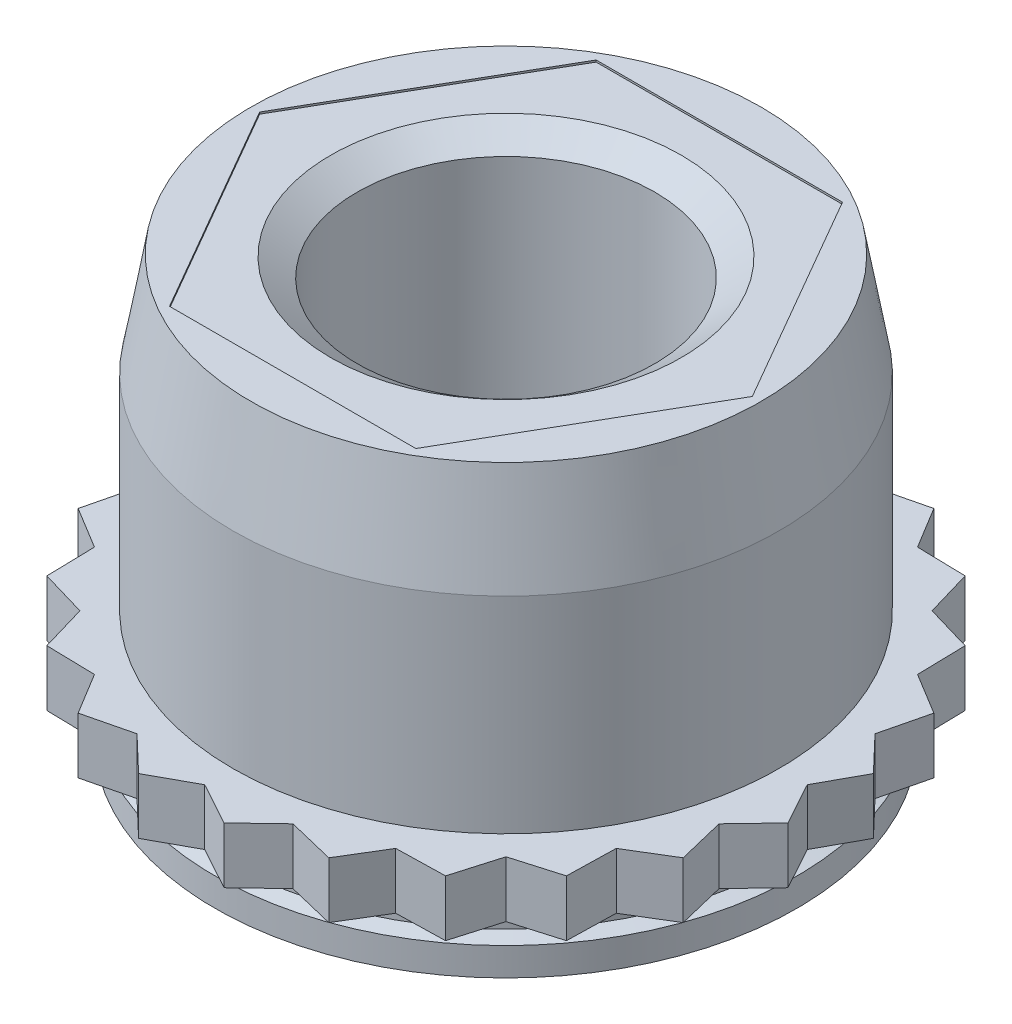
ISO-10303-21;
HEADER;
FILE_DESCRIPTION(('STEP AP214'),'2;1');
FILE_NAME('part.step','',(''),(''),'','','');
FILE_SCHEMA(('AUTOMOTIVE_DESIGN { 1 0 10303 214 1 1 1 1 }'));
ENDSEC;
DATA;
#1=APPLICATION_CONTEXT('core data for automotive mechanical design processes');
#2=APPLICATION_PROTOCOL_DEFINITION('international standard','automotive_design',2000,#1);
#3=PRODUCT_CONTEXT('',#1,'mechanical');
#4=PRODUCT('Part','Part','',(#3));
#5=PRODUCT_RELATED_PRODUCT_CATEGORY('part','',(#4));
#6=PRODUCT_DEFINITION_FORMATION('','',#4);
#7=PRODUCT_DEFINITION_CONTEXT('part definition',#1,'design');
#8=PRODUCT_DEFINITION('design','',#6,#7);
#9=PRODUCT_DEFINITION_SHAPE('','',#8);
#10=(LENGTH_UNIT() NAMED_UNIT(*) SI_UNIT(.MILLI.,.METRE.));
#11=(NAMED_UNIT(*) PLANE_ANGLE_UNIT() SI_UNIT($,.RADIAN.));
#12=(NAMED_UNIT(*) SI_UNIT($,.STERADIAN.) SOLID_ANGLE_UNIT());
#13=UNCERTAINTY_MEASURE_WITH_UNIT(LENGTH_MEASURE(1.E-05),#10,'distance_accuracy_value','');
#14=(GEOMETRIC_REPRESENTATION_CONTEXT(3) GLOBAL_UNCERTAINTY_ASSIGNED_CONTEXT((#13)) GLOBAL_UNIT_ASSIGNED_CONTEXT((#10,
#11,#12)) REPRESENTATION_CONTEXT('',''));
#15=CARTESIAN_POINT('',(0.,0.,0.));
#16=DIRECTION('',(0.,0.,1.));
#17=DIRECTION('',(1.,0.,0.));
#18=AXIS2_PLACEMENT_3D('',#15,#16,#17);
#19=CARTESIAN_POINT('',(0.,0.,0.));
#20=DIRECTION('',(0.,-1.,0.));
#21=DIRECTION('',(0.,0.,-1.));
#22=AXIS2_PLACEMENT_3D('',#19,#20,#21);
#23=CYLINDRICAL_SURFACE('',#22,3.7084);
#24=CARTESIAN_POINT('',(0.,2.794,0.));
#25=DIRECTION('',(0.,-1.,0.));
#26=DIRECTION('',(0.,0.,-1.));
#27=AXIS2_PLACEMENT_3D('',#24,#25,#26);
#28=CIRCLE('',#27,3.7084);
#29=CARTESIAN_POINT('',(0.,2.794,-3.7084));
#30=VERTEX_POINT('',#29);
#31=EDGE_CURVE('E11',#30,#30,#28,.T.);
#32=ORIENTED_EDGE('',*,*,#31,.T.);
#33=EDGE_LOOP('',(#32));
#34=FACE_BOUND('',#33,.T.);
#35=CARTESIAN_POINT('',(0.,0.,0.));
#36=DIRECTION('',(0.,-1.,0.));
#37=DIRECTION('',(0.,0.,-1.));
#38=AXIS2_PLACEMENT_3D('',#35,#36,#37);
#39=CIRCLE('',#38,3.7084);
#40=CARTESIAN_POINT('',(0.,0.,-3.7084));
#41=VERTEX_POINT('',#40);
#42=EDGE_CURVE('E825',#41,#41,#39,.T.);
#43=ORIENTED_EDGE('',*,*,#42,.F.);
#44=EDGE_LOOP('',(#43));
#45=FACE_BOUND('',#44,.T.);
#46=ADVANCED_FACE('F35',(#34,#45),#23,.T.);
#47=CARTESIAN_POINT('',(0.,2.794,0.));
#48=DIRECTION('',(0.,-1.,0.));
#49=DIRECTION('',(0.,0.,-1.));
#50=AXIS2_PLACEMENT_3D('',#47,#48,#49);
#51=CONICAL_SURFACE('',#50,3.7084,0.174532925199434);
#52=CARTESIAN_POINT('',(0.,4.191,0.));
#53=DIRECTION('',(0.,-1.,0.));
#54=DIRECTION('',(0.,0.,-1.));
#55=AXIS2_PLACEMENT_3D('',#52,#53,#54);
#56=CIRCLE('',#55,3.46207120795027);
#57=CARTESIAN_POINT('',(0.,4.191,-3.46207120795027));
#58=VERTEX_POINT('',#57);
#59=EDGE_CURVE('E43',#58,#58,#56,.T.);
#60=ORIENTED_EDGE('',*,*,#59,.T.);
#61=EDGE_LOOP('',(#60));
#62=FACE_BOUND('',#61,.T.);
#63=ORIENTED_EDGE('',*,*,#31,.F.);
#64=EDGE_LOOP('',(#63));
#65=FACE_BOUND('',#64,.T.);
#66=ADVANCED_FACE('F866',(#62,#65),#51,.T.);
#67=CARTESIAN_POINT('',(3.46207120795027,4.191,0.));
#68=DIRECTION('',(0.,1.,0.));
#69=DIRECTION('',(0.,0.,1.));
#70=AXIS2_PLACEMENT_3D('',#67,#68,#69);
#71=PLANE('',#70);
#72=DIRECTION('',(0.5,0.,-0.866025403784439));
#73=VECTOR('',#72,1.);
#74=CARTESIAN_POINT('',(3.34355087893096,4.191,0.));
#75=LINE('',#74,#73);
#76=CARTESIAN_POINT('',(1.67177543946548,4.191,2.8956));
#77=VERTEX_POINT('',#76);
#78=CARTESIAN_POINT('',(3.34355087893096,4.191,0.));
#79=VERTEX_POINT('',#78);
#80=EDGE_CURVE('E51',#77,#79,#75,.T.);
#81=ORIENTED_EDGE('',*,*,#80,.F.);
#82=DIRECTION('',(1.,0.,0.));
#83=VECTOR('',#82,1.);
#84=CARTESIAN_POINT('',(1.67177543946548,4.191,2.8956));
#85=LINE('',#84,#83);
#86=CARTESIAN_POINT('',(-1.67177543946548,4.191,2.8956));
#87=VERTEX_POINT('',#86);
#88=EDGE_CURVE('E400',#87,#77,#85,.T.);
#89=ORIENTED_EDGE('',*,*,#88,.F.);
#90=DIRECTION('',(0.5,0.,0.866025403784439));
#91=VECTOR('',#90,1.);
#92=CARTESIAN_POINT('',(-1.67177543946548,4.191,2.8956));
#93=LINE('',#92,#91);
#94=CARTESIAN_POINT('',(-3.34355087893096,4.191,0.));
#95=VERTEX_POINT('',#94);
#96=EDGE_CURVE('E403',#95,#87,#93,.T.);
#97=ORIENTED_EDGE('',*,*,#96,.F.);
#98=DIRECTION('',(-0.5,0.,0.866025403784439));
#99=VECTOR('',#98,1.);
#100=CARTESIAN_POINT('',(-3.34355087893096,4.191,0.));
#101=LINE('',#100,#99);
#102=CARTESIAN_POINT('',(-1.67177543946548,4.191,-2.8956));
#103=VERTEX_POINT('',#102);
#104=EDGE_CURVE('E419',#103,#95,#101,.T.);
#105=ORIENTED_EDGE('',*,*,#104,.F.);
#106=DIRECTION('',(-1.,0.,0.));
#107=VECTOR('',#106,1.);
#108=CARTESIAN_POINT('',(-1.67177543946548,4.191,-2.8956));
#109=LINE('',#108,#107);
#110=CARTESIAN_POINT('',(1.67177543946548,4.191,-2.8956));
#111=VERTEX_POINT('',#110);
#112=EDGE_CURVE('E416',#111,#103,#109,.T.);
#113=ORIENTED_EDGE('',*,*,#112,.F.);
#114=DIRECTION('',(-0.5,0.,-0.866025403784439));
#115=VECTOR('',#114,1.);
#116=CARTESIAN_POINT('',(1.67177543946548,4.191,-2.8956));
#117=LINE('',#116,#115);
#118=EDGE_CURVE('E414',#79,#111,#117,.T.);
#119=ORIENTED_EDGE('',*,*,#118,.F.);
#120=EDGE_LOOP('',(#81,#89,#97,#105,#113,#119));
#121=FACE_BOUND('',#120,.T.);
#122=ORIENTED_EDGE('',*,*,#59,.F.);
#123=EDGE_LOOP('',(#122));
#124=FACE_BOUND('',#123,.T.);
#125=ADVANCED_FACE('F871',(#121,#124),#71,.T.);
#126=CARTESIAN_POINT('',(0.,0.,0.));
#127=DIRECTION('',(0.,-1.,0.));
#128=DIRECTION('',(0.,0.,-1.));
#129=AXIS2_PLACEMENT_3D('',#126,#127,#128);
#130=CYLINDRICAL_SURFACE('',#129,2.0193);
#131=CARTESIAN_POINT('',(0.,3.91289068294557,0.));
#132=DIRECTION('',(0.,-1.,0.));
#133=DIRECTION('',(0.,0.,-1.));
#134=AXIS2_PLACEMENT_3D('',#131,#132,#133);
#135=CIRCLE('',#134,2.0193);
#136=CARTESIAN_POINT('',(0.,3.91289068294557,-2.0193));
#137=VERTEX_POINT('',#136);
#138=EDGE_CURVE('E811',#137,#137,#135,.T.);
#139=ORIENTED_EDGE('',*,*,#138,.F.);
#140=EDGE_LOOP('',(#139));
#141=FACE_BOUND('',#140,.T.);
#142=CARTESIAN_POINT('',(0.,-1.24589068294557,0.));
#143=DIRECTION('',(0.,-1.,0.));
#144=DIRECTION('',(0.,0.,-1.));
#145=AXIS2_PLACEMENT_3D('',#142,#143,#144);
#146=CIRCLE('',#145,2.0193);
#147=CARTESIAN_POINT('',(0.,-1.24589068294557,-2.0193));
#148=VERTEX_POINT('',#147);
#149=EDGE_CURVE('E821',#148,#148,#146,.T.);
#150=ORIENTED_EDGE('',*,*,#149,.T.);
#151=EDGE_LOOP('',(#150));
#152=FACE_BOUND('',#151,.T.);
#153=ADVANCED_FACE('F851',(#141,#152),#130,.F.);
#154=CARTESIAN_POINT('',(2.0193,-1.524,0.));
#155=DIRECTION('',(0.,-1.,0.));
#156=DIRECTION('',(0.,0.,-1.));
#157=AXIS2_PLACEMENT_3D('',#154,#155,#156);
#158=PLANE('',#157);
#159=CARTESIAN_POINT('',(0.,-1.524,0.));
#160=DIRECTION('',(0.,-1.,0.));
#161=DIRECTION('',(0.,0.,-1.));
#162=AXIS2_PLACEMENT_3D('',#159,#160,#161);
#163=CIRCLE('',#162,2.413);
#164=CARTESIAN_POINT('',(0.,-1.524,-2.413));
#165=VERTEX_POINT('',#164);
#166=EDGE_CURVE('E824',#165,#165,#163,.T.);
#167=ORIENTED_EDGE('',*,*,#166,.F.);
#168=EDGE_LOOP('',(#167));
#169=FACE_BOUND('',#168,.T.);
#170=CARTESIAN_POINT('',(0.,-1.524,0.));
#171=DIRECTION('',(0.,-1.,0.));
#172=DIRECTION('',(0.,0.,-1.));
#173=AXIS2_PLACEMENT_3D('',#170,#171,#172);
#174=CIRCLE('',#173,3.9497);
#175=CARTESIAN_POINT('',(0.,-1.524,-3.9497));
#176=VERTEX_POINT('',#175);
#177=EDGE_CURVE('E837',#176,#176,#174,.T.);
#178=ORIENTED_EDGE('',*,*,#177,.T.);
#179=EDGE_LOOP('',(#178));
#180=FACE_BOUND('',#179,.T.);
#181=ADVANCED_FACE('F847',(#169,#180),#158,.T.);
#182=CARTESIAN_POINT('',(0.,0.,0.));
#183=DIRECTION('',(0.,-1.,0.));
#184=DIRECTION('',(0.,0.,-1.));
#185=AXIS2_PLACEMENT_3D('',#182,#183,#184);
#186=CYLINDRICAL_SURFACE('',#185,3.9497);
#187=CARTESIAN_POINT('',(0.,-1.143,0.));
#188=DIRECTION('',(0.,-1.,0.));
#189=DIRECTION('',(0.,0.,-1.));
#190=AXIS2_PLACEMENT_3D('',#187,#188,#189);
#191=CIRCLE('',#190,3.9497);
#192=CARTESIAN_POINT('',(0.,-1.143,-3.9497));
#193=VERTEX_POINT('',#192);
#194=EDGE_CURVE('E834',#193,#193,#191,.T.);
#195=ORIENTED_EDGE('',*,*,#194,.T.);
#196=EDGE_LOOP('',(#195));
#197=FACE_BOUND('',#196,.T.);
#198=ORIENTED_EDGE('',*,*,#177,.F.);
#199=EDGE_LOOP('',(#198));
#200=FACE_BOUND('',#199,.T.);
#201=ADVANCED_FACE('F850',(#197,#200),#186,.T.);
#202=CARTESIAN_POINT('',(0.,-1.143,0.));
#203=DIRECTION('',(0.,-1.,0.));
#204=DIRECTION('',(0.,0.,-1.));
#205=AXIS2_PLACEMENT_3D('',#202,#203,#204);
#206=CONICAL_SURFACE('',#205,3.9497,1.30899693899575);
#207=CARTESIAN_POINT('',(0.,-1.09008405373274,0.));
#208=DIRECTION('',(0.,-1.,0.));
#209=DIRECTION('',(0.,0.,-1.));
#210=AXIS2_PLACEMENT_3D('',#207,#208,#209);
#211=CIRCLE('',#210,3.752215);
#212=CARTESIAN_POINT('',(0.,-1.09008405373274,-3.752215));
#213=VERTEX_POINT('',#212);
#214=EDGE_CURVE('E831',#213,#213,#211,.T.);
#215=ORIENTED_EDGE('',*,*,#214,.T.);
#216=EDGE_LOOP('',(#215));
#217=FACE_BOUND('',#216,.T.);
#218=ORIENTED_EDGE('',*,*,#194,.F.);
#219=EDGE_LOOP('',(#218));
#220=FACE_BOUND('',#219,.T.);
#221=ADVANCED_FACE('F856',(#217,#220),#206,.T.);
#222=CARTESIAN_POINT('',(0.,0.,0.));
#223=DIRECTION('',(0.,-1.,0.));
#224=DIRECTION('',(0.,0.,-1.));
#225=AXIS2_PLACEMENT_3D('',#222,#223,#224);
#226=CYLINDRICAL_SURFACE('',#225,3.752215);
#227=CARTESIAN_POINT('',(0.,-0.762,0.));
#228=DIRECTION('',(0.,-1.,0.));
#229=DIRECTION('',(0.,0.,-1.));
#230=AXIS2_PLACEMENT_3D('',#227,#228,#229);
#231=CIRCLE('',#230,3.752215);
#232=CARTESIAN_POINT('',(0.,-0.762,-3.752215));
#233=VERTEX_POINT('',#232);
#234=EDGE_CURVE('E828',#233,#233,#231,.T.);
#235=ORIENTED_EDGE('',*,*,#234,.T.);
#236=EDGE_LOOP('',(#235));
#237=FACE_BOUND('',#236,.T.);
#238=ORIENTED_EDGE('',*,*,#214,.F.);
#239=EDGE_LOOP('',(#238));
#240=FACE_BOUND('',#239,.T.);
#241=ADVANCED_FACE('F862',(#237,#240),#226,.T.);
#242=CARTESIAN_POINT('',(3.752215,-0.762,0.));
#243=DIRECTION('',(0.,-1.,0.));
#244=DIRECTION('',(0.,0.,-1.));
#245=AXIS2_PLACEMENT_3D('',#242,#243,#244);
#246=PLANE('',#245);
#247=DIRECTION('',(0.723032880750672,0.,0.690813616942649));
#248=VECTOR('',#247,1.);
#249=CARTESIAN_POINT('',(-0.580188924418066,-0.762,4.40697240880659));
#250=LINE('',#249,#248);
#251=CARTESIAN_POINT('',(-1.0584146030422,-0.762,3.95005707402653));
#252=VERTEX_POINT('',#251);
#253=CARTESIAN_POINT('',(-0.580188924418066,-0.762,4.40697240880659));
#254=VERTEX_POINT('',#253);
#255=EDGE_CURVE('E437',#252,#254,#250,.T.);
#256=ORIENTED_EDGE('',*,*,#255,.F.);
#257=DIRECTION('',(0.971571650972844,0.,-0.236745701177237));
#258=VECTOR('',#257,1.);
#259=CARTESIAN_POINT('',(-1.0584146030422,-0.762,3.95005707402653));
#260=LINE('',#259,#258);
#261=CARTESIAN_POINT('',(-1.70102785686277,-0.762,4.10664452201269));
#262=VERTEX_POINT('',#261);
#263=EDGE_CURVE('E435',#262,#252,#260,.T.);
#264=ORIENTED_EDGE('',*,*,#263,.F.);
#265=DIRECTION('',(0.519600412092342,0.,0.854409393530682));
#266=VECTOR('',#265,1.);
#267=CARTESIAN_POINT('',(-1.70102785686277,-0.762,4.10664452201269));
#268=LINE('',#267,#266);
#269=CARTESIAN_POINT('',(-2.04469999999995,-0.762,3.54152428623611));
#270=VERTEX_POINT('',#269);
#271=EDGE_CURVE('E453',#270,#262,#268,.T.);
#272=ORIENTED_EDGE('',*,*,#271,.F.);
#273=DIRECTION('',(0.999740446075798,0.,0.0227824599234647));
#274=VECTOR('',#273,1.);
#275=CARTESIAN_POINT('',(-2.04469999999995,-0.762,3.54152428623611));
#276=LINE('',#275,#274);
#277=CARTESIAN_POINT('',(-2.70594455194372,-0.762,3.52645559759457));
#278=VERTEX_POINT('',#277);
#279=EDGE_CURVE('E449',#278,#270,#276,.T.);
#280=ORIENTED_EDGE('',*,*,#279,.F.);
#281=DIRECTION('',(0.2807580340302,0.,0.959778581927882));
#282=VECTOR('',#281,1.);
#283=CARTESIAN_POINT('',(-2.70594455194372,-0.762,3.52645559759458));
#284=LINE('',#283,#282);
#285=CARTESIAN_POINT('',(-2.89164247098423,-0.762,2.8916424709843));
#286=VERTEX_POINT('',#285);
#287=EDGE_CURVE('E469',#286,#278,#284,.T.);
#288=ORIENTED_EDGE('',*,*,#287,.F.);
#289=DIRECTION('',(0.959778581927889,0.,0.280758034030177));
#290=VECTOR('',#289,1.);
#291=CARTESIAN_POINT('',(-2.89164247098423,-0.762,2.8916424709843));
#292=LINE('',#291,#290);
#293=CARTESIAN_POINT('',(-3.52645559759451,-0.762,2.7059445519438));
#294=VERTEX_POINT('',#293);
#295=EDGE_CURVE('E465',#294,#286,#292,.T.);
#296=ORIENTED_EDGE('',*,*,#295,.F.);
#297=DIRECTION('',(0.0227824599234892,0.,0.999740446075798));
#298=VECTOR('',#297,1.);
#299=CARTESIAN_POINT('',(-3.52645559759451,-0.762,2.70594455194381));
#300=LINE('',#299,#298);
#301=CARTESIAN_POINT('',(-3.54152428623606,-0.762,2.04470000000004));
#302=VERTEX_POINT('',#301);
#303=EDGE_CURVE('E485',#302,#294,#300,.T.);
#304=ORIENTED_EDGE('',*,*,#303,.F.);
#305=DIRECTION('',(0.854409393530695,0.,0.519600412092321));
#306=VECTOR('',#305,1.);
#307=CARTESIAN_POINT('',(-3.54152428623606,-0.762,2.04470000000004));
#308=LINE('',#307,#306);
#309=CARTESIAN_POINT('',(-4.10664452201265,-0.762,1.70102785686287));
#310=VERTEX_POINT('',#309);
#311=EDGE_CURVE('E481',#310,#302,#308,.T.);
#312=ORIENTED_EDGE('',*,*,#311,.F.);
#313=DIRECTION('',(-0.236745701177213,0.,0.97157165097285));
#314=VECTOR('',#313,1.);
#315=CARTESIAN_POINT('',(-4.10664452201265,-0.762,1.70102785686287));
#316=LINE('',#315,#314);
#317=CARTESIAN_POINT('',(-3.9500570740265,-0.762,1.05841460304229));
#318=VERTEX_POINT('',#317);
#319=EDGE_CURVE('E501',#318,#310,#316,.T.);
#320=ORIENTED_EDGE('',*,*,#319,.F.);
#321=DIRECTION('',(0.690813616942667,0.,0.723032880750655));
#322=VECTOR('',#321,1.);
#323=CARTESIAN_POINT('',(-3.9500570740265,-0.762,1.05841460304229));
#324=LINE('',#323,#322);
#325=CARTESIAN_POINT('',(-4.40697240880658,-0.762,0.580188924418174));
#326=VERTEX_POINT('',#325);
#327=EDGE_CURVE('E497',#326,#318,#324,.T.);
#328=ORIENTED_EDGE('',*,*,#327,.F.);
#329=DIRECTION('',(-0.480140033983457,0.,0.877191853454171));
#330=VECTOR('',#329,1.);
#331=CARTESIAN_POINT('',(-4.40697240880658,-0.762,0.58018892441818));
#332=LINE('',#331,#330);
#333=CARTESIAN_POINT('',(-4.0894,-0.762,0.));
#334=VERTEX_POINT('',#333);
#335=EDGE_CURVE('E517',#334,#326,#332,.T.);
#336=ORIENTED_EDGE('',*,*,#335,.F.);
#337=DIRECTION('',(0.480140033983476,0.,0.877191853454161));
#338=VECTOR('',#337,1.);
#339=CARTESIAN_POINT('',(-4.0894,-0.762,0.));
#340=LINE('',#339,#338);
#341=CARTESIAN_POINT('',(-4.40697240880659,-0.762,-0.580188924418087));
#342=VERTEX_POINT('',#341);
#343=EDGE_CURVE('E513',#342,#334,#340,.T.);
#344=ORIENTED_EDGE('',*,*,#343,.F.);
#345=DIRECTION('',(-0.690813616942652,0.,0.723032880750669));
#346=VECTOR('',#345,1.);
#347=CARTESIAN_POINT('',(-4.40697240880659,-0.762,-0.580188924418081));
#348=LINE('',#347,#346);
#349=CARTESIAN_POINT('',(-3.95005707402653,-0.762,-1.05841460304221));
#350=VERTEX_POINT('',#349);
#351=EDGE_CURVE('E533',#350,#342,#348,.T.);
#352=ORIENTED_EDGE('',*,*,#351,.F.);
#353=DIRECTION('',(0.236745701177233,0.,0.971571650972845));
#354=VECTOR('',#353,1.);
#355=CARTESIAN_POINT('',(-3.95005707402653,-0.762,-1.05841460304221));
#356=LINE('',#355,#354);
#357=CARTESIAN_POINT('',(-4.10664452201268,-0.762,-1.70102785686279));
#358=VERTEX_POINT('',#357);
#359=EDGE_CURVE('E529',#358,#350,#356,.T.);
#360=ORIENTED_EDGE('',*,*,#359,.F.);
#361=DIRECTION('',(-0.854409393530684,0.,0.519600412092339));
#362=VECTOR('',#361,1.);
#363=CARTESIAN_POINT('',(-4.10664452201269,-0.762,-1.70102785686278));
#364=LINE('',#363,#362);
#365=CARTESIAN_POINT('',(-3.5415242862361,-0.762,-2.04469999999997));
#366=VERTEX_POINT('',#365);
#367=EDGE_CURVE('E549',#366,#358,#364,.T.);
#368=ORIENTED_EDGE('',*,*,#367,.F.);
#369=DIRECTION('',(-0.0227824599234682,0.,0.999740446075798));
#370=VECTOR('',#369,1.);
#371=CARTESIAN_POINT('',(-3.5415242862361,-0.762,-2.04469999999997));
#372=LINE('',#371,#370);
#373=CARTESIAN_POINT('',(-3.52645559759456,-0.762,-2.70594455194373));
#374=VERTEX_POINT('',#373);
#375=EDGE_CURVE('E545',#374,#366,#372,.T.);
#376=ORIENTED_EDGE('',*,*,#375,.F.);
#377=DIRECTION('',(-0.959778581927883,0.,0.280758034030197));
#378=VECTOR('',#377,1.);
#379=CARTESIAN_POINT('',(-3.52645559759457,-0.762,-2.70594455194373));
#380=LINE('',#379,#378);
#381=CARTESIAN_POINT('',(-2.89164247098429,-0.762,-2.89164247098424));
#382=VERTEX_POINT('',#381);
#383=EDGE_CURVE('E565',#382,#374,#380,.T.);
#384=ORIENTED_EDGE('',*,*,#383,.F.);
#385=DIRECTION('',(-0.28075803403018,0.,0.959778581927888));
#386=VECTOR('',#385,1.);
#387=CARTESIAN_POINT('',(-2.89164247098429,-0.762,-2.89164247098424));
#388=LINE('',#387,#386);
#389=CARTESIAN_POINT('',(-2.70594455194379,-0.762,-3.52645559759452));
#390=VERTEX_POINT('',#389);
#391=EDGE_CURVE('E561',#390,#382,#388,.T.);
#392=ORIENTED_EDGE('',*,*,#391,.F.);
#393=DIRECTION('',(-0.999740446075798,0.,0.0227824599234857));
#394=VECTOR('',#393,1.);
#395=CARTESIAN_POINT('',(-2.7059445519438,-0.762,-3.52645559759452));
#396=LINE('',#395,#394);
#397=CARTESIAN_POINT('',(-2.04470000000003,-0.762,-3.54152428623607));
#398=VERTEX_POINT('',#397);
#399=EDGE_CURVE('E581',#398,#390,#396,.T.);
#400=ORIENTED_EDGE('',*,*,#399,.F.);
#401=DIRECTION('',(-0.519600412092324,0.,0.854409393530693));
#402=VECTOR('',#401,1.);
#403=CARTESIAN_POINT('',(-2.04470000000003,-0.762,-3.54152428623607));
#404=LINE('',#403,#402);
#405=CARTESIAN_POINT('',(-1.70102785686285,-0.762,-4.10664452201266));
#406=VERTEX_POINT('',#405);
#407=EDGE_CURVE('E577',#406,#398,#404,.T.);
#408=ORIENTED_EDGE('',*,*,#407,.F.);
#409=DIRECTION('',(-0.971571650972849,0.,-0.236745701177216));
#410=VECTOR('',#409,1.);
#411=CARTESIAN_POINT('',(-1.70102785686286,-0.762,-4.10664452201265));
#412=LINE('',#411,#410);
#413=CARTESIAN_POINT('',(-1.05841460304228,-0.762,-3.95005707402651));
#414=VERTEX_POINT('',#413);
#415=EDGE_CURVE('E597',#414,#406,#412,.T.);
#416=ORIENTED_EDGE('',*,*,#415,.F.);
#417=DIRECTION('',(-0.723032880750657,0.,0.690813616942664));
#418=VECTOR('',#417,1.);
#419=CARTESIAN_POINT('',(-1.05841460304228,-0.762,-3.95005707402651));
#420=LINE('',#419,#418);
#421=CARTESIAN_POINT('',(-0.580188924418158,-0.762,-4.40697240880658));
#422=VERTEX_POINT('',#421);
#423=EDGE_CURVE('E593',#422,#414,#420,.T.);
#424=ORIENTED_EDGE('',*,*,#423,.F.);
#425=DIRECTION('',(-0.87719185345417,0.,-0.48014003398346));
#426=VECTOR('',#425,1.);
#427=CARTESIAN_POINT('',(-0.580188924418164,-0.762,-4.40697240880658));
#428=LINE('',#427,#426);
#429=CARTESIAN_POINT('',(0.,-0.762,-4.0894));
#430=VERTEX_POINT('',#429);
#431=EDGE_CURVE('E613',#430,#422,#428,.T.);
#432=ORIENTED_EDGE('',*,*,#431,.F.);
#433=DIRECTION('',(-0.877191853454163,0.,0.480140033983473));
#434=VECTOR('',#433,1.);
#435=CARTESIAN_POINT('',(0.,-0.762,-4.0894));
#436=LINE('',#435,#434);
#437=CARTESIAN_POINT('',(0.580188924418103,-0.762,-4.40697240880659));
#438=VERTEX_POINT('',#437);
#439=EDGE_CURVE('E609',#438,#430,#436,.T.);
#440=ORIENTED_EDGE('',*,*,#439,.F.);
#441=DIRECTION('',(-0.723032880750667,0.,-0.690813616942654));
#442=VECTOR('',#441,1.);
#443=CARTESIAN_POINT('',(0.580188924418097,-0.762,-4.40697240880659));
#444=LINE('',#443,#442);
#445=CARTESIAN_POINT('',(1.05841460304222,-0.762,-3.95005707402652));
#446=VERTEX_POINT('',#445);
#447=EDGE_CURVE('E629',#446,#438,#444,.T.);
#448=ORIENTED_EDGE('',*,*,#447,.F.);
#449=DIRECTION('',(-0.971571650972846,0.,0.23674570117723));
#450=VECTOR('',#449,1.);
#451=CARTESIAN_POINT('',(1.05841460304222,-0.762,-3.95005707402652));
#452=LINE('',#451,#450);
#453=CARTESIAN_POINT('',(1.7010278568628,-0.762,-4.10664452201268));
#454=VERTEX_POINT('',#453);
#455=EDGE_CURVE('E625',#454,#446,#452,.T.);
#456=ORIENTED_EDGE('',*,*,#455,.F.);
#457=DIRECTION('',(-0.519600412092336,0.,-0.854409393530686));
#458=VECTOR('',#457,1.);
#459=CARTESIAN_POINT('',(1.7010278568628,-0.762,-4.10664452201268));
#460=LINE('',#459,#458);
#461=CARTESIAN_POINT('',(2.04469999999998,-0.762,-3.5415242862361));
#462=VERTEX_POINT('',#461);
#463=EDGE_CURVE('E645',#462,#454,#460,.T.);
#464=ORIENTED_EDGE('',*,*,#463,.F.);
#465=DIRECTION('',(-0.999740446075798,0.,-0.0227824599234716));
#466=VECTOR('',#465,1.);
#467=CARTESIAN_POINT('',(2.04469999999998,-0.762,-3.5415242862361));
#468=LINE('',#467,#466);
#469=CARTESIAN_POINT('',(2.70594455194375,-0.762,-3.52645559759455));
#470=VERTEX_POINT('',#469);
#471=EDGE_CURVE('E641',#470,#462,#468,.T.);
#472=ORIENTED_EDGE('',*,*,#471,.F.);
#473=DIRECTION('',(-0.280758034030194,0.,-0.959778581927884));
#474=VECTOR('',#473,1.);
#475=CARTESIAN_POINT('',(2.70594455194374,-0.762,-3.52645559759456));
#476=LINE('',#475,#474);
#477=CARTESIAN_POINT('',(2.89164247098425,-0.762,-2.89164247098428));
#478=VERTEX_POINT('',#477);
#479=EDGE_CURVE('E661',#478,#470,#476,.T.);
#480=ORIENTED_EDGE('',*,*,#479,.F.);
#481=DIRECTION('',(-0.959778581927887,0.,-0.280758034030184));
#482=VECTOR('',#481,1.);
#483=CARTESIAN_POINT('',(2.89164247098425,-0.762,-2.89164247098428));
#484=LINE('',#483,#482);
#485=CARTESIAN_POINT('',(3.52645559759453,-0.762,-2.70594455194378));
#486=VERTEX_POINT('',#485);
#487=EDGE_CURVE('E657',#486,#478,#484,.T.);
#488=ORIENTED_EDGE('',*,*,#487,.F.);
#489=DIRECTION('',(-0.0227824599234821,0.,-0.999740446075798));
#490=VECTOR('',#489,1.);
#491=CARTESIAN_POINT('',(3.52645559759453,-0.762,-2.70594455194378));
#492=LINE('',#491,#490);
#493=CARTESIAN_POINT('',(3.54152428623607,-0.762,-2.04470000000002));
#494=VERTEX_POINT('',#493);
#495=EDGE_CURVE('E677',#494,#486,#492,.T.);
#496=ORIENTED_EDGE('',*,*,#495,.F.);
#497=DIRECTION('',(-0.854409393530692,0.,-0.519600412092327));
#498=VECTOR('',#497,1.);
#499=CARTESIAN_POINT('',(3.54152428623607,-0.762,-2.04470000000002));
#500=LINE('',#499,#498);
#501=CARTESIAN_POINT('',(4.10664452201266,-0.762,-1.70102785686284));
#502=VERTEX_POINT('',#501);
#503=EDGE_CURVE('E673',#502,#494,#500,.T.);
#504=ORIENTED_EDGE('',*,*,#503,.F.);
#505=DIRECTION('',(0.23674570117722,0.,-0.971571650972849));
#506=VECTOR('',#505,1.);
#507=CARTESIAN_POINT('',(4.10664452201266,-0.762,-1.70102785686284));
#508=LINE('',#507,#506);
#509=CARTESIAN_POINT('',(3.95005707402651,-0.762,-1.05841460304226));
#510=VERTEX_POINT('',#509);
#511=EDGE_CURVE('E693',#510,#502,#508,.T.);
#512=ORIENTED_EDGE('',*,*,#511,.F.);
#513=DIRECTION('',(-0.690813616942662,0.,-0.72303288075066));
#514=VECTOR('',#513,1.);
#515=CARTESIAN_POINT('',(3.95005707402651,-0.762,-1.05841460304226));
#516=LINE('',#515,#514);
#517=CARTESIAN_POINT('',(4.40697240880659,-0.762,-0.580188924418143));
#518=VERTEX_POINT('',#517);
#519=EDGE_CURVE('E689',#518,#510,#516,.T.);
#520=ORIENTED_EDGE('',*,*,#519,.F.);
#521=DIRECTION('',(0.480140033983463,0.,-0.877191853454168));
#522=VECTOR('',#521,1.);
#523=CARTESIAN_POINT('',(4.40697240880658,-0.762,-0.580188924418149));
#524=LINE('',#523,#522);
#525=CARTESIAN_POINT('',(4.0894,-0.762,0.));
#526=VERTEX_POINT('',#525);
#527=EDGE_CURVE('E709',#526,#518,#524,.T.);
#528=ORIENTED_EDGE('',*,*,#527,.F.);
#529=DIRECTION('',(-0.48014003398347,0.,-0.877191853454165));
#530=VECTOR('',#529,1.);
#531=CARTESIAN_POINT('',(4.0894,-0.762,0.));
#532=LINE('',#531,#530);
#533=CARTESIAN_POINT('',(4.40697240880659,-0.762,0.580188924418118));
#534=VERTEX_POINT('',#533);
#535=EDGE_CURVE('E705',#534,#526,#532,.T.);
#536=ORIENTED_EDGE('',*,*,#535,.F.);
#537=DIRECTION('',(0.690813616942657,0.,-0.723032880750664));
#538=VECTOR('',#537,1.);
#539=CARTESIAN_POINT('',(4.40697240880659,-0.762,0.580188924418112));
#540=LINE('',#539,#538);
#541=CARTESIAN_POINT('',(3.95005707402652,-0.762,1.05841460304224));
#542=VERTEX_POINT('',#541);
#543=EDGE_CURVE('E725',#542,#534,#540,.T.);
#544=ORIENTED_EDGE('',*,*,#543,.F.);
#545=DIRECTION('',(-0.236745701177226,0.,-0.971571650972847));
#546=VECTOR('',#545,1.);
#547=CARTESIAN_POINT('',(3.95005707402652,-0.762,1.05841460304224));
#548=LINE('',#547,#546);
#549=CARTESIAN_POINT('',(4.10664452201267,-0.762,1.70102785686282));
#550=VERTEX_POINT('',#549);
#551=EDGE_CURVE('E721',#550,#542,#548,.T.);
#552=ORIENTED_EDGE('',*,*,#551,.F.);
#553=DIRECTION('',(0.854409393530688,0.,-0.519600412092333));
#554=VECTOR('',#553,1.);
#555=CARTESIAN_POINT('',(4.10664452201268,-0.762,1.70102785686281));
#556=LINE('',#555,#554);
#557=CARTESIAN_POINT('',(3.54152428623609,-0.762,2.04469999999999));
#558=VERTEX_POINT('',#557);
#559=EDGE_CURVE('E741',#558,#550,#556,.T.);
#560=ORIENTED_EDGE('',*,*,#559,.F.);
#561=DIRECTION('',(0.0227824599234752,0.,-0.999740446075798));
#562=VECTOR('',#561,1.);
#563=CARTESIAN_POINT('',(3.54152428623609,-0.762,2.04469999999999));
#564=LINE('',#563,#562);
#565=CARTESIAN_POINT('',(3.52645559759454,-0.762,2.70594455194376));
#566=VERTEX_POINT('',#565);
#567=EDGE_CURVE('E737',#566,#558,#564,.T.);
#568=ORIENTED_EDGE('',*,*,#567,.F.);
#569=DIRECTION('',(0.959778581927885,0.,-0.28075803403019));
#570=VECTOR('',#569,1.);
#571=CARTESIAN_POINT('',(3.52645559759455,-0.762,2.70594455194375));
#572=LINE('',#571,#570);
#573=CARTESIAN_POINT('',(2.89164247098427,-0.762,2.89164247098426));
#574=VERTEX_POINT('',#573);
#575=EDGE_CURVE('E757',#574,#566,#572,.T.);
#576=ORIENTED_EDGE('',*,*,#575,.F.);
#577=DIRECTION('',(0.280758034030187,0.,-0.959778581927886));
#578=VECTOR('',#577,1.);
#579=CARTESIAN_POINT('',(2.89164247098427,-0.762,2.89164247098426));
#580=LINE('',#579,#578);
#581=CARTESIAN_POINT('',(2.70594455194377,-0.762,3.52645559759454));
#582=VERTEX_POINT('',#581);
#583=EDGE_CURVE('E753',#582,#574,#580,.T.);
#584=ORIENTED_EDGE('',*,*,#583,.F.);
#585=DIRECTION('',(0.999740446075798,0.,-0.0227824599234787));
#586=VECTOR('',#585,1.);
#587=CARTESIAN_POINT('',(2.70594455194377,-0.762,3.52645559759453));
#588=LINE('',#587,#586);
#589=CARTESIAN_POINT('',(2.0447,-0.762,3.54152428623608));
#590=VERTEX_POINT('',#589);
#591=EDGE_CURVE('E773',#590,#582,#588,.T.);
#592=ORIENTED_EDGE('',*,*,#591,.F.);
#593=DIRECTION('',(0.51960041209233,0.,-0.85440939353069));
#594=VECTOR('',#593,1.);
#595=CARTESIAN_POINT('',(2.0447,-0.762,3.54152428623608));
#596=LINE('',#595,#594);
#597=CARTESIAN_POINT('',(1.70102785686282,-0.762,4.10664452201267));
#598=VERTEX_POINT('',#597);
#599=EDGE_CURVE('E769',#598,#590,#596,.T.);
#600=ORIENTED_EDGE('',*,*,#599,.F.);
#601=DIRECTION('',(0.971571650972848,0.,0.236745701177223));
#602=VECTOR('',#601,1.);
#603=CARTESIAN_POINT('',(1.70102785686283,-0.762,4.10664452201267));
#604=LINE('',#603,#602);
#605=CARTESIAN_POINT('',(1.05841460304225,-0.762,3.95005707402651));
#606=VERTEX_POINT('',#605);
#607=EDGE_CURVE('E787',#606,#598,#604,.T.);
#608=ORIENTED_EDGE('',*,*,#607,.F.);
#609=DIRECTION('',(0.723032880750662,0.,-0.690813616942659));
#610=VECTOR('',#609,1.);
#611=CARTESIAN_POINT('',(1.05841460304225,-0.762,3.95005707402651));
#612=LINE('',#611,#610);
#613=CARTESIAN_POINT('',(0.580188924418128,-0.762,4.40697240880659));
#614=VERTEX_POINT('',#613);
#615=EDGE_CURVE('E776',#614,#606,#612,.T.);
#616=ORIENTED_EDGE('',*,*,#615,.F.);
#617=DIRECTION('',(0.877191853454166,0.,0.480140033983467));
#618=VECTOR('',#617,1.);
#619=CARTESIAN_POINT('',(0.580188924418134,-0.762,4.40697240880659));
#620=LINE('',#619,#618);
#621=CARTESIAN_POINT('',(0.,-0.762,4.0894));
#622=VERTEX_POINT('',#621);
#623=EDGE_CURVE('E802',#622,#614,#620,.T.);
#624=ORIENTED_EDGE('',*,*,#623,.F.);
#625=DIRECTION('',(0.877191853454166,0.,-0.480140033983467));
#626=VECTOR('',#625,1.);
#627=CARTESIAN_POINT('',(0.,-0.762,4.0894));
#628=LINE('',#627,#626);
#629=EDGE_CURVE('E797',#254,#622,#628,.T.);
#630=ORIENTED_EDGE('',*,*,#629,.F.);
#631=EDGE_LOOP('',(#256,#264,#272,#280,#288,#296,#304,#312,#320,#328,#336,#344,#352,#360,#368,
#376,#384,#392,#400,#408,#416,#424,#432,#440,#448,#456,#464,#472,#480,#488,#496,#504,#512,#520,
#528,#536,#544,#552,#560,#568,#576,#584,#592,#600,#608,#616,#624,#630));
#632=FACE_BOUND('',#631,.T.);
#633=ORIENTED_EDGE('',*,*,#234,.F.);
#634=EDGE_LOOP('',(#633));
#635=FACE_BOUND('',#634,.T.);
#636=ADVANCED_FACE('F880',(#632,#635),#246,.T.);
#637=CARTESIAN_POINT('',(4.445,0.,0.));
#638=DIRECTION('',(0.,1.,0.));
#639=DIRECTION('',(0.,0.,1.));
#640=AXIS2_PLACEMENT_3D('',#637,#638,#639);
#641=PLANE('',#640);
#642=DIRECTION('',(0.723032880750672,0.,0.690813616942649));
#643=VECTOR('',#642,1.);
#644=CARTESIAN_POINT('',(-0.580188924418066,0.,4.40697240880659));
#645=LINE('',#644,#643);
#646=CARTESIAN_POINT('',(-1.0584146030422,0.,3.95005707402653));
#647=VERTEX_POINT('',#646);
#648=CARTESIAN_POINT('',(-0.580188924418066,0.,4.40697240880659));
#649=VERTEX_POINT('',#648);
#650=EDGE_CURVE('E442',#647,#649,#645,.T.);
#651=ORIENTED_EDGE('',*,*,#650,.T.);
#652=DIRECTION('',(0.877191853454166,0.,-0.480140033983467));
#653=VECTOR('',#652,1.);
#654=CARTESIAN_POINT('',(0.,0.,4.0894));
#655=LINE('',#654,#653);
#656=CARTESIAN_POINT('',(0.,0.,4.0894));
#657=VERTEX_POINT('',#656);
#658=EDGE_CURVE('E799',#649,#657,#655,.T.);
#659=ORIENTED_EDGE('',*,*,#658,.T.);
#660=DIRECTION('',(0.877191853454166,0.,0.480140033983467));
#661=VECTOR('',#660,1.);
#662=CARTESIAN_POINT('',(0.580188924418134,0.,4.40697240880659));
#663=LINE('',#662,#661);
#664=CARTESIAN_POINT('',(0.580188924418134,0.,4.40697240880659));
#665=VERTEX_POINT('',#664);
#666=EDGE_CURVE('E59',#657,#665,#663,.T.);
#667=ORIENTED_EDGE('',*,*,#666,.T.);
#668=DIRECTION('',(0.723032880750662,0.,-0.690813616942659));
#669=VECTOR('',#668,1.);
#670=CARTESIAN_POINT('',(1.05841460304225,0.,3.95005707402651));
#671=LINE('',#670,#669);
#672=CARTESIAN_POINT('',(1.05841460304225,0.,3.95005707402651));
#673=VERTEX_POINT('',#672);
#674=EDGE_CURVE('E783',#665,#673,#671,.T.);
#675=ORIENTED_EDGE('',*,*,#674,.T.);
#676=DIRECTION('',(0.971571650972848,0.,0.236745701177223));
#677=VECTOR('',#676,1.);
#678=CARTESIAN_POINT('',(1.70102785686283,0.,4.10664452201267));
#679=LINE('',#678,#677);
#680=CARTESIAN_POINT('',(1.70102785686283,0.,4.10664452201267));
#681=VERTEX_POINT('',#680);
#682=EDGE_CURVE('E786',#673,#681,#679,.T.);
#683=ORIENTED_EDGE('',*,*,#682,.T.);
#684=DIRECTION('',(0.51960041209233,0.,-0.85440939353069));
#685=VECTOR('',#684,1.);
#686=CARTESIAN_POINT('',(2.0447,0.,3.54152428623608));
#687=LINE('',#686,#685);
#688=CARTESIAN_POINT('',(2.0447,0.,3.54152428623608));
#689=VERTEX_POINT('',#688);
#690=EDGE_CURVE('E770',#681,#689,#687,.T.);
#691=ORIENTED_EDGE('',*,*,#690,.T.);
#692=DIRECTION('',(0.999740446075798,0.,-0.0227824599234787));
#693=VECTOR('',#692,1.);
#694=CARTESIAN_POINT('',(2.70594455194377,0.,3.52645559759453));
#695=LINE('',#694,#693);
#696=CARTESIAN_POINT('',(2.70594455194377,0.,3.52645559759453));
#697=VERTEX_POINT('',#696);
#698=EDGE_CURVE('E760',#689,#697,#695,.T.);
#699=ORIENTED_EDGE('',*,*,#698,.T.);
#700=DIRECTION('',(0.280758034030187,0.,-0.959778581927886));
#701=VECTOR('',#700,1.);
#702=CARTESIAN_POINT('',(2.89164247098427,0.,2.89164247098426));
#703=LINE('',#702,#701);
#704=CARTESIAN_POINT('',(2.89164247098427,0.,2.89164247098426));
#705=VERTEX_POINT('',#704);
#706=EDGE_CURVE('E754',#697,#705,#703,.T.);
#707=ORIENTED_EDGE('',*,*,#706,.T.);
#708=DIRECTION('',(0.959778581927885,0.,-0.28075803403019));
#709=VECTOR('',#708,1.);
#710=CARTESIAN_POINT('',(3.52645559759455,0.,2.70594455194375));
#711=LINE('',#710,#709);
#712=CARTESIAN_POINT('',(3.52645559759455,0.,2.70594455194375));
#713=VERTEX_POINT('',#712);
#714=EDGE_CURVE('E744',#705,#713,#711,.T.);
#715=ORIENTED_EDGE('',*,*,#714,.T.);
#716=DIRECTION('',(0.0227824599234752,0.,-0.999740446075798));
#717=VECTOR('',#716,1.);
#718=CARTESIAN_POINT('',(3.54152428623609,0.,2.04469999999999));
#719=LINE('',#718,#717);
#720=CARTESIAN_POINT('',(3.54152428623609,0.,2.04469999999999));
#721=VERTEX_POINT('',#720);
#722=EDGE_CURVE('E738',#713,#721,#719,.T.);
#723=ORIENTED_EDGE('',*,*,#722,.T.);
#724=DIRECTION('',(0.854409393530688,0.,-0.519600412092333));
#725=VECTOR('',#724,1.);
#726=CARTESIAN_POINT('',(4.10664452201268,0.,1.70102785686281));
#727=LINE('',#726,#725);
#728=CARTESIAN_POINT('',(4.10664452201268,0.,1.70102785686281));
#729=VERTEX_POINT('',#728);
#730=EDGE_CURVE('E728',#721,#729,#727,.T.);
#731=ORIENTED_EDGE('',*,*,#730,.T.);
#732=DIRECTION('',(-0.236745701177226,0.,-0.971571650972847));
#733=VECTOR('',#732,1.);
#734=CARTESIAN_POINT('',(3.95005707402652,0.,1.05841460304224));
#735=LINE('',#734,#733);
#736=CARTESIAN_POINT('',(3.95005707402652,0.,1.05841460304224));
#737=VERTEX_POINT('',#736);
#738=EDGE_CURVE('E722',#729,#737,#735,.T.);
#739=ORIENTED_EDGE('',*,*,#738,.T.);
#740=DIRECTION('',(0.690813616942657,0.,-0.723032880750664));
#741=VECTOR('',#740,1.);
#742=CARTESIAN_POINT('',(4.40697240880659,0.,0.580188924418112));
#743=LINE('',#742,#741);
#744=CARTESIAN_POINT('',(4.40697240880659,0.,0.580188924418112));
#745=VERTEX_POINT('',#744);
#746=EDGE_CURVE('E712',#737,#745,#743,.T.);
#747=ORIENTED_EDGE('',*,*,#746,.T.);
#748=DIRECTION('',(-0.48014003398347,0.,-0.877191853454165));
#749=VECTOR('',#748,1.);
#750=CARTESIAN_POINT('',(4.0894,0.,0.));
#751=LINE('',#750,#749);
#752=CARTESIAN_POINT('',(4.0894,0.,0.));
#753=VERTEX_POINT('',#752);
#754=EDGE_CURVE('E706',#745,#753,#751,.T.);
#755=ORIENTED_EDGE('',*,*,#754,.T.);
#756=DIRECTION('',(0.480140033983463,0.,-0.877191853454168));
#757=VECTOR('',#756,1.);
#758=CARTESIAN_POINT('',(4.40697240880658,0.,-0.580188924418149));
#759=LINE('',#758,#757);
#760=CARTESIAN_POINT('',(4.40697240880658,0.,-0.580188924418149));
#761=VERTEX_POINT('',#760);
#762=EDGE_CURVE('E696',#753,#761,#759,.T.);
#763=ORIENTED_EDGE('',*,*,#762,.T.);
#764=DIRECTION('',(-0.690813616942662,0.,-0.72303288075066));
#765=VECTOR('',#764,1.);
#766=CARTESIAN_POINT('',(3.95005707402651,0.,-1.05841460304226));
#767=LINE('',#766,#765);
#768=CARTESIAN_POINT('',(3.95005707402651,0.,-1.05841460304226));
#769=VERTEX_POINT('',#768);
#770=EDGE_CURVE('E690',#761,#769,#767,.T.);
#771=ORIENTED_EDGE('',*,*,#770,.T.);
#772=DIRECTION('',(0.23674570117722,0.,-0.971571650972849));
#773=VECTOR('',#772,1.);
#774=CARTESIAN_POINT('',(4.10664452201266,0.,-1.70102785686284));
#775=LINE('',#774,#773);
#776=CARTESIAN_POINT('',(4.10664452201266,0.,-1.70102785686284));
#777=VERTEX_POINT('',#776);
#778=EDGE_CURVE('E680',#769,#777,#775,.T.);
#779=ORIENTED_EDGE('',*,*,#778,.T.);
#780=DIRECTION('',(-0.854409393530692,0.,-0.519600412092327));
#781=VECTOR('',#780,1.);
#782=CARTESIAN_POINT('',(3.54152428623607,0.,-2.04470000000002));
#783=LINE('',#782,#781);
#784=CARTESIAN_POINT('',(3.54152428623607,0.,-2.04470000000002));
#785=VERTEX_POINT('',#784);
#786=EDGE_CURVE('E674',#777,#785,#783,.T.);
#787=ORIENTED_EDGE('',*,*,#786,.T.);
#788=DIRECTION('',(-0.0227824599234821,0.,-0.999740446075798));
#789=VECTOR('',#788,1.);
#790=CARTESIAN_POINT('',(3.52645559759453,0.,-2.70594455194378));
#791=LINE('',#790,#789);
#792=CARTESIAN_POINT('',(3.52645559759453,0.,-2.70594455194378));
#793=VERTEX_POINT('',#792);
#794=EDGE_CURVE('E664',#785,#793,#791,.T.);
#795=ORIENTED_EDGE('',*,*,#794,.T.);
#796=DIRECTION('',(-0.959778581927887,0.,-0.280758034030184));
#797=VECTOR('',#796,1.);
#798=CARTESIAN_POINT('',(2.89164247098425,0.,-2.89164247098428));
#799=LINE('',#798,#797);
#800=CARTESIAN_POINT('',(2.89164247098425,0.,-2.89164247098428));
#801=VERTEX_POINT('',#800);
#802=EDGE_CURVE('E658',#793,#801,#799,.T.);
#803=ORIENTED_EDGE('',*,*,#802,.T.);
#804=DIRECTION('',(-0.280758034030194,0.,-0.959778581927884));
#805=VECTOR('',#804,1.);
#806=CARTESIAN_POINT('',(2.70594455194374,0.,-3.52645559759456));
#807=LINE('',#806,#805);
#808=CARTESIAN_POINT('',(2.70594455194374,0.,-3.52645559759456));
#809=VERTEX_POINT('',#808);
#810=EDGE_CURVE('E648',#801,#809,#807,.T.);
#811=ORIENTED_EDGE('',*,*,#810,.T.);
#812=DIRECTION('',(-0.999740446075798,0.,-0.0227824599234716));
#813=VECTOR('',#812,1.);
#814=CARTESIAN_POINT('',(2.04469999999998,0.,-3.5415242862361));
#815=LINE('',#814,#813);
#816=CARTESIAN_POINT('',(2.04469999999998,0.,-3.5415242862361));
#817=VERTEX_POINT('',#816);
#818=EDGE_CURVE('E642',#809,#817,#815,.T.);
#819=ORIENTED_EDGE('',*,*,#818,.T.);
#820=DIRECTION('',(-0.519600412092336,0.,-0.854409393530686));
#821=VECTOR('',#820,1.);
#822=CARTESIAN_POINT('',(1.7010278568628,0.,-4.10664452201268));
#823=LINE('',#822,#821);
#824=CARTESIAN_POINT('',(1.7010278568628,0.,-4.10664452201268));
#825=VERTEX_POINT('',#824);
#826=EDGE_CURVE('E632',#817,#825,#823,.T.);
#827=ORIENTED_EDGE('',*,*,#826,.T.);
#828=DIRECTION('',(-0.971571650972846,0.,0.23674570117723));
#829=VECTOR('',#828,1.);
#830=CARTESIAN_POINT('',(1.05841460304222,0.,-3.95005707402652));
#831=LINE('',#830,#829);
#832=CARTESIAN_POINT('',(1.05841460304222,0.,-3.95005707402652));
#833=VERTEX_POINT('',#832);
#834=EDGE_CURVE('E626',#825,#833,#831,.T.);
#835=ORIENTED_EDGE('',*,*,#834,.T.);
#836=DIRECTION('',(-0.723032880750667,0.,-0.690813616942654));
#837=VECTOR('',#836,1.);
#838=CARTESIAN_POINT('',(0.580188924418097,0.,-4.40697240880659));
#839=LINE('',#838,#837);
#840=CARTESIAN_POINT('',(0.580188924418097,0.,-4.40697240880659));
#841=VERTEX_POINT('',#840);
#842=EDGE_CURVE('E616',#833,#841,#839,.T.);
#843=ORIENTED_EDGE('',*,*,#842,.T.);
#844=DIRECTION('',(-0.877191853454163,0.,0.480140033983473));
#845=VECTOR('',#844,1.);
#846=CARTESIAN_POINT('',(0.,0.,-4.0894));
#847=LINE('',#846,#845);
#848=CARTESIAN_POINT('',(0.,0.,-4.0894));
#849=VERTEX_POINT('',#848);
#850=EDGE_CURVE('E610',#841,#849,#847,.T.);
#851=ORIENTED_EDGE('',*,*,#850,.T.);
#852=DIRECTION('',(-0.87719185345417,0.,-0.48014003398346));
#853=VECTOR('',#852,1.);
#854=CARTESIAN_POINT('',(-0.580188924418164,0.,-4.40697240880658));
#855=LINE('',#854,#853);
#856=CARTESIAN_POINT('',(-0.580188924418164,0.,-4.40697240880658));
#857=VERTEX_POINT('',#856);
#858=EDGE_CURVE('E600',#849,#857,#855,.T.);
#859=ORIENTED_EDGE('',*,*,#858,.T.);
#860=DIRECTION('',(-0.723032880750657,0.,0.690813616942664));
#861=VECTOR('',#860,1.);
#862=CARTESIAN_POINT('',(-1.05841460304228,0.,-3.95005707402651));
#863=LINE('',#862,#861);
#864=CARTESIAN_POINT('',(-1.05841460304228,0.,-3.95005707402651));
#865=VERTEX_POINT('',#864);
#866=EDGE_CURVE('E594',#857,#865,#863,.T.);
#867=ORIENTED_EDGE('',*,*,#866,.T.);
#868=DIRECTION('',(-0.971571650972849,0.,-0.236745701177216));
#869=VECTOR('',#868,1.);
#870=CARTESIAN_POINT('',(-1.70102785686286,0.,-4.10664452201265));
#871=LINE('',#870,#869);
#872=CARTESIAN_POINT('',(-1.70102785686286,0.,-4.10664452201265));
#873=VERTEX_POINT('',#872);
#874=EDGE_CURVE('E584',#865,#873,#871,.T.);
#875=ORIENTED_EDGE('',*,*,#874,.T.);
#876=DIRECTION('',(-0.519600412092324,0.,0.854409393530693));
#877=VECTOR('',#876,1.);
#878=CARTESIAN_POINT('',(-2.04470000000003,0.,-3.54152428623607));
#879=LINE('',#878,#877);
#880=CARTESIAN_POINT('',(-2.04470000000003,0.,-3.54152428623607));
#881=VERTEX_POINT('',#880);
#882=EDGE_CURVE('E578',#873,#881,#879,.T.);
#883=ORIENTED_EDGE('',*,*,#882,.T.);
#884=DIRECTION('',(-0.999740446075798,0.,0.0227824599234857));
#885=VECTOR('',#884,1.);
#886=CARTESIAN_POINT('',(-2.7059445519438,0.,-3.52645559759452));
#887=LINE('',#886,#885);
#888=CARTESIAN_POINT('',(-2.7059445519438,0.,-3.52645559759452));
#889=VERTEX_POINT('',#888);
#890=EDGE_CURVE('E568',#881,#889,#887,.T.);
#891=ORIENTED_EDGE('',*,*,#890,.T.);
#892=DIRECTION('',(-0.28075803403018,0.,0.959778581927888));
#893=VECTOR('',#892,1.);
#894=CARTESIAN_POINT('',(-2.89164247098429,0.,-2.89164247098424));
#895=LINE('',#894,#893);
#896=CARTESIAN_POINT('',(-2.89164247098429,0.,-2.89164247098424));
#897=VERTEX_POINT('',#896);
#898=EDGE_CURVE('E562',#889,#897,#895,.T.);
#899=ORIENTED_EDGE('',*,*,#898,.T.);
#900=DIRECTION('',(-0.959778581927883,0.,0.280758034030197));
#901=VECTOR('',#900,1.);
#902=CARTESIAN_POINT('',(-3.52645559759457,0.,-2.70594455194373));
#903=LINE('',#902,#901);
#904=CARTESIAN_POINT('',(-3.52645559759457,0.,-2.70594455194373));
#905=VERTEX_POINT('',#904);
#906=EDGE_CURVE('E552',#897,#905,#903,.T.);
#907=ORIENTED_EDGE('',*,*,#906,.T.);
#908=DIRECTION('',(-0.0227824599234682,0.,0.999740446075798));
#909=VECTOR('',#908,1.);
#910=CARTESIAN_POINT('',(-3.5415242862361,0.,-2.04469999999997));
#911=LINE('',#910,#909);
#912=CARTESIAN_POINT('',(-3.5415242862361,0.,-2.04469999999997));
#913=VERTEX_POINT('',#912);
#914=EDGE_CURVE('E546',#905,#913,#911,.T.);
#915=ORIENTED_EDGE('',*,*,#914,.T.);
#916=DIRECTION('',(-0.854409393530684,0.,0.519600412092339));
#917=VECTOR('',#916,1.);
#918=CARTESIAN_POINT('',(-4.10664452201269,0.,-1.70102785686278));
#919=LINE('',#918,#917);
#920=CARTESIAN_POINT('',(-4.10664452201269,0.,-1.70102785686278));
#921=VERTEX_POINT('',#920);
#922=EDGE_CURVE('E536',#913,#921,#919,.T.);
#923=ORIENTED_EDGE('',*,*,#922,.T.);
#924=DIRECTION('',(0.236745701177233,0.,0.971571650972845));
#925=VECTOR('',#924,1.);
#926=CARTESIAN_POINT('',(-3.95005707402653,0.,-1.05841460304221));
#927=LINE('',#926,#925);
#928=CARTESIAN_POINT('',(-3.95005707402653,0.,-1.05841460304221));
#929=VERTEX_POINT('',#928);
#930=EDGE_CURVE('E530',#921,#929,#927,.T.);
#931=ORIENTED_EDGE('',*,*,#930,.T.);
#932=DIRECTION('',(-0.690813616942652,0.,0.723032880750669));
#933=VECTOR('',#932,1.);
#934=CARTESIAN_POINT('',(-4.40697240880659,0.,-0.580188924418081));
#935=LINE('',#934,#933);
#936=CARTESIAN_POINT('',(-4.40697240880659,0.,-0.580188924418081));
#937=VERTEX_POINT('',#936);
#938=EDGE_CURVE('E520',#929,#937,#935,.T.);
#939=ORIENTED_EDGE('',*,*,#938,.T.);
#940=DIRECTION('',(0.480140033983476,0.,0.877191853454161));
#941=VECTOR('',#940,1.);
#942=CARTESIAN_POINT('',(-4.0894,0.,0.));
#943=LINE('',#942,#941);
#944=CARTESIAN_POINT('',(-4.0894,0.,0.));
#945=VERTEX_POINT('',#944);
#946=EDGE_CURVE('E514',#937,#945,#943,.T.);
#947=ORIENTED_EDGE('',*,*,#946,.T.);
#948=DIRECTION('',(-0.480140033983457,0.,0.877191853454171));
#949=VECTOR('',#948,1.);
#950=CARTESIAN_POINT('',(-4.40697240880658,0.,0.58018892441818));
#951=LINE('',#950,#949);
#952=CARTESIAN_POINT('',(-4.40697240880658,0.,0.58018892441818));
#953=VERTEX_POINT('',#952);
#954=EDGE_CURVE('E504',#945,#953,#951,.T.);
#955=ORIENTED_EDGE('',*,*,#954,.T.);
#956=DIRECTION('',(0.690813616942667,0.,0.723032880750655));
#957=VECTOR('',#956,1.);
#958=CARTESIAN_POINT('',(-3.9500570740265,0.,1.05841460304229));
#959=LINE('',#958,#957);
#960=CARTESIAN_POINT('',(-3.9500570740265,0.,1.05841460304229));
#961=VERTEX_POINT('',#960);
#962=EDGE_CURVE('E498',#953,#961,#959,.T.);
#963=ORIENTED_EDGE('',*,*,#962,.T.);
#964=DIRECTION('',(-0.236745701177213,0.,0.97157165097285));
#965=VECTOR('',#964,1.);
#966=CARTESIAN_POINT('',(-4.10664452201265,0.,1.70102785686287));
#967=LINE('',#966,#965);
#968=CARTESIAN_POINT('',(-4.10664452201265,0.,1.70102785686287));
#969=VERTEX_POINT('',#968);
#970=EDGE_CURVE('E488',#961,#969,#967,.T.);
#971=ORIENTED_EDGE('',*,*,#970,.T.);
#972=DIRECTION('',(0.854409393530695,0.,0.519600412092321));
#973=VECTOR('',#972,1.);
#974=CARTESIAN_POINT('',(-3.54152428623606,0.,2.04470000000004));
#975=LINE('',#974,#973);
#976=CARTESIAN_POINT('',(-3.54152428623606,0.,2.04470000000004));
#977=VERTEX_POINT('',#976);
#978=EDGE_CURVE('E482',#969,#977,#975,.T.);
#979=ORIENTED_EDGE('',*,*,#978,.T.);
#980=DIRECTION('',(0.0227824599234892,0.,0.999740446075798));
#981=VECTOR('',#980,1.);
#982=CARTESIAN_POINT('',(-3.52645559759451,0.,2.70594455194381));
#983=LINE('',#982,#981);
#984=CARTESIAN_POINT('',(-3.52645559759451,0.,2.70594455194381));
#985=VERTEX_POINT('',#984);
#986=EDGE_CURVE('E472',#977,#985,#983,.T.);
#987=ORIENTED_EDGE('',*,*,#986,.T.);
#988=DIRECTION('',(0.959778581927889,0.,0.280758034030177));
#989=VECTOR('',#988,1.);
#990=CARTESIAN_POINT('',(-2.89164247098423,0.,2.8916424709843));
#991=LINE('',#990,#989);
#992=CARTESIAN_POINT('',(-2.89164247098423,0.,2.8916424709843));
#993=VERTEX_POINT('',#992);
#994=EDGE_CURVE('E466',#985,#993,#991,.T.);
#995=ORIENTED_EDGE('',*,*,#994,.T.);
#996=DIRECTION('',(0.2807580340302,0.,0.959778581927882));
#997=VECTOR('',#996,1.);
#998=CARTESIAN_POINT('',(-2.70594455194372,0.,3.52645559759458));
#999=LINE('',#998,#997);
#1000=CARTESIAN_POINT('',(-2.70594455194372,0.,3.52645559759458));
#1001=VERTEX_POINT('',#1000);
#1002=EDGE_CURVE('E456',#993,#1001,#999,.T.);
#1003=ORIENTED_EDGE('',*,*,#1002,.T.);
#1004=DIRECTION('',(0.999740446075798,0.,0.0227824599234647));
#1005=VECTOR('',#1004,1.);
#1006=CARTESIAN_POINT('',(-2.04469999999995,0.,3.54152428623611));
#1007=LINE('',#1006,#1005);
#1008=CARTESIAN_POINT('',(-2.04469999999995,0.,3.54152428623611));
#1009=VERTEX_POINT('',#1008);
#1010=EDGE_CURVE('E450',#1001,#1009,#1007,.T.);
#1011=ORIENTED_EDGE('',*,*,#1010,.T.);
#1012=DIRECTION('',(0.519600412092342,0.,0.854409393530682));
#1013=VECTOR('',#1012,1.);
#1014=CARTESIAN_POINT('',(-1.70102785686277,0.,4.10664452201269));
#1015=LINE('',#1014,#1013);
#1016=CARTESIAN_POINT('',(-1.70102785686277,0.,4.10664452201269));
#1017=VERTEX_POINT('',#1016);
#1018=EDGE_CURVE('E439',#1009,#1017,#1015,.T.);
#1019=ORIENTED_EDGE('',*,*,#1018,.T.);
#1020=DIRECTION('',(0.971571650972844,0.,-0.236745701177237));
#1021=VECTOR('',#1020,1.);
#1022=CARTESIAN_POINT('',(-1.0584146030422,0.,3.95005707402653));
#1023=LINE('',#1022,#1021);
#1024=EDGE_CURVE('E436',#1017,#647,#1023,.T.);
#1025=ORIENTED_EDGE('',*,*,#1024,.T.);
#1026=EDGE_LOOP('',(#651,#659,#667,#675,#683,#691,#699,#707,#715,#723,#731,#739,#747,#755,#763,
#771,#779,#787,#795,#803,#811,#819,#827,#835,#843,#851,#859,#867,#875,#883,#891,#899,#907,#915,
#923,#931,#939,#947,#955,#963,#971,#979,#987,#995,#1003,#1011,#1019,#1025));
#1027=FACE_BOUND('',#1026,.T.);
#1028=ORIENTED_EDGE('',*,*,#42,.T.);
#1029=EDGE_LOOP('',(#1028));
#1030=FACE_BOUND('',#1029,.T.);
#1031=ADVANCED_FACE('F877',(#1027,#1030),#641,.T.);
#1032=CARTESIAN_POINT('',(0.,-1.52146,0.));
#1033=DIRECTION('',(0.,-1.,0.));
#1034=DIRECTION('',(0.,0.,-1.));
#1035=AXIS2_PLACEMENT_3D('',#1032,#1033,#1034);
#1036=CONICAL_SURFACE('',#1035,2.413,0.960105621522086);
#1037=ORIENTED_EDGE('',*,*,#149,.F.);
#1038=EDGE_LOOP('',(#1037));
#1039=FACE_BOUND('',#1038,.T.);
#1040=CARTESIAN_POINT('',(0.,-1.52146,0.));
#1041=DIRECTION('',(0.,-1.,0.));
#1042=DIRECTION('',(0.,0.,-1.));
#1043=AXIS2_PLACEMENT_3D('',#1040,#1041,#1042);
#1044=CIRCLE('',#1043,2.413);
#1045=CARTESIAN_POINT('',(0.,-1.52146,-2.413));
#1046=VERTEX_POINT('',#1045);
#1047=EDGE_CURVE('E818',#1046,#1046,#1044,.T.);
#1048=ORIENTED_EDGE('',*,*,#1047,.T.);
#1049=EDGE_LOOP('',(#1048));
#1050=FACE_BOUND('',#1049,.T.);
#1051=ADVANCED_FACE('F879',(#1039,#1050),#1036,.F.);
#1052=CARTESIAN_POINT('',(0.,-2.54,0.));
#1053=DIRECTION('',(0.,-1.,0.));
#1054=DIRECTION('',(0.,0.,-1.));
#1055=AXIS2_PLACEMENT_3D('',#1052,#1053,#1054);
#1056=CYLINDRICAL_SURFACE('',#1055,2.413);
#1057=ORIENTED_EDGE('',*,*,#166,.T.);
#1058=EDGE_LOOP('',(#1057));
#1059=FACE_BOUND('',#1058,.T.);
#1060=ORIENTED_EDGE('',*,*,#1047,.F.);
#1061=EDGE_LOOP('',(#1060));
#1062=FACE_BOUND('',#1061,.T.);
#1063=ADVANCED_FACE('F844',(#1059,#1062),#1056,.F.);
#1064=CARTESIAN_POINT('',(0.,3.91289068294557,0.));
#1065=DIRECTION('',(0.,1.,0.));
#1066=DIRECTION('',(0.,0.,1.));
#1067=AXIS2_PLACEMENT_3D('',#1064,#1065,#1066);
#1068=CONICAL_SURFACE('',#1067,2.0193,0.960105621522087);
#1069=CARTESIAN_POINT('',(0.,4.1656,0.));
#1070=DIRECTION('',(0.,-1.,0.));
#1071=DIRECTION('',(0.,0.,-1.));
#1072=AXIS2_PLACEMENT_3D('',#1069,#1070,#1071);
#1073=CIRCLE('',#1072,2.38034040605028);
#1074=CARTESIAN_POINT('',(0.,4.1656,-2.38034040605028));
#1075=VERTEX_POINT('',#1074);
#1076=EDGE_CURVE('E38',#1075,#1075,#1073,.F.);
#1077=ORIENTED_EDGE('',*,*,#1076,.T.);
#1078=EDGE_LOOP('',(#1077));
#1079=FACE_BOUND('',#1078,.T.);
#1080=ORIENTED_EDGE('',*,*,#138,.T.);
#1081=EDGE_LOOP('',(#1080));
#1082=FACE_BOUND('',#1081,.T.);
#1083=ADVANCED_FACE('F931',(#1079,#1082),#1068,.F.);
#1084=CARTESIAN_POINT('',(0.580188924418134,0.,4.40697240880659));
#1085=DIRECTION('',(0.480140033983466,0.,-0.877191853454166));
#1086=DIRECTION('',(-0.877191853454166,0.,-0.480140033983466));
#1087=AXIS2_PLACEMENT_3D('',#1084,#1085,#1086);
#1088=PLANE('',#1087);
#1089=ORIENTED_EDGE('',*,*,#623,.T.);
#1090=DIRECTION('',(0.,-1.,0.));
#1091=VECTOR('',#1090,1.);
#1092=CARTESIAN_POINT('',(0.580188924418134,0.,4.40697240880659));
#1093=LINE('',#1092,#1091);
#1094=EDGE_CURVE('E809',#665,#614,#1093,.T.);
#1095=ORIENTED_EDGE('',*,*,#1094,.F.);
#1096=ORIENTED_EDGE('',*,*,#666,.F.);
#1097=DIRECTION('',(0.,-1.,0.));
#1098=VECTOR('',#1097,1.);
#1099=CARTESIAN_POINT('',(0.,0.,4.0894));
#1100=LINE('',#1099,#1098);
#1101=EDGE_CURVE('E812',#657,#622,#1100,.T.);
#1102=ORIENTED_EDGE('',*,*,#1101,.T.);
#1103=EDGE_LOOP('',(#1089,#1095,#1096,#1102));
#1104=FACE_BOUND('',#1103,.T.);
#1105=ADVANCED_FACE('F925',(#1104),#1088,.F.);
#1106=CARTESIAN_POINT('',(0.,0.,4.0894));
#1107=DIRECTION('',(-0.480140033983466,0.,-0.877191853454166));
#1108=DIRECTION('',(-0.877191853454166,0.,0.480140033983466));
#1109=AXIS2_PLACEMENT_3D('',#1106,#1107,#1108);
#1110=PLANE('',#1109);
#1111=ORIENTED_EDGE('',*,*,#629,.T.);
#1112=ORIENTED_EDGE('',*,*,#1101,.F.);
#1113=ORIENTED_EDGE('',*,*,#658,.F.);
#1114=DIRECTION('',(0.,-1.,0.));
#1115=VECTOR('',#1114,1.);
#1116=CARTESIAN_POINT('',(-0.580188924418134,0.,4.40697240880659));
#1117=LINE('',#1116,#1115);
#1118=EDGE_CURVE('E804',#649,#254,#1117,.T.);
#1119=ORIENTED_EDGE('',*,*,#1118,.T.);
#1120=EDGE_LOOP('',(#1111,#1112,#1113,#1119));
#1121=FACE_BOUND('',#1120,.T.);
#1122=ADVANCED_FACE('F930',(#1121),#1110,.F.);
#1123=CARTESIAN_POINT('',(1.70102785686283,0.,4.10664452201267));
#1124=DIRECTION('',(0.236745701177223,0.,-0.971571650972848));
#1125=DIRECTION('',(-0.971571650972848,0.,-0.236745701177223));
#1126=AXIS2_PLACEMENT_3D('',#1123,#1124,#1125);
#1127=PLANE('',#1126);
#1128=ORIENTED_EDGE('',*,*,#607,.T.);
#1129=DIRECTION('',(0.,-1.,0.));
#1130=VECTOR('',#1129,1.);
#1131=CARTESIAN_POINT('',(1.70102785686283,0.,4.10664452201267));
#1132=LINE('',#1131,#1130);
#1133=EDGE_CURVE('E795',#681,#598,#1132,.T.);
#1134=ORIENTED_EDGE('',*,*,#1133,.F.);
#1135=ORIENTED_EDGE('',*,*,#682,.F.);
#1136=DIRECTION('',(0.,-1.,0.));
#1137=VECTOR('',#1136,1.);
#1138=CARTESIAN_POINT('',(1.05841460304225,0.,3.95005707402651));
#1139=LINE('',#1138,#1137);
#1140=EDGE_CURVE('E790',#673,#606,#1139,.T.);
#1141=ORIENTED_EDGE('',*,*,#1140,.T.);
#1142=EDGE_LOOP('',(#1128,#1134,#1135,#1141));
#1143=FACE_BOUND('',#1142,.T.);
#1144=ADVANCED_FACE('F942',(#1143),#1127,.F.);
#1145=CARTESIAN_POINT('',(1.05841460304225,0.,3.95005707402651));
#1146=DIRECTION('',(-0.690813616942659,0.,-0.723032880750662));
#1147=DIRECTION('',(-0.723032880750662,0.,0.690813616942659));
#1148=AXIS2_PLACEMENT_3D('',#1145,#1146,#1147);
#1149=PLANE('',#1148);
#1150=ORIENTED_EDGE('',*,*,#615,.T.);
#1151=ORIENTED_EDGE('',*,*,#1140,.F.);
#1152=ORIENTED_EDGE('',*,*,#674,.F.);
#1153=ORIENTED_EDGE('',*,*,#1094,.T.);
#1154=EDGE_LOOP('',(#1150,#1151,#1152,#1153));
#1155=FACE_BOUND('',#1154,.T.);
#1156=ADVANCED_FACE('F952',(#1155),#1149,.F.);
#1157=CARTESIAN_POINT('',(2.70594455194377,0.,3.52645559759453));
#1158=DIRECTION('',(-0.0227824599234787,0.,-0.999740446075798));
#1159=DIRECTION('',(-0.999740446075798,0.,0.0227824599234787));
#1160=AXIS2_PLACEMENT_3D('',#1157,#1158,#1159);
#1161=PLANE('',#1160);
#1162=ORIENTED_EDGE('',*,*,#591,.T.);
#1163=DIRECTION('',(0.,-1.,0.));
#1164=VECTOR('',#1163,1.);
#1165=CARTESIAN_POINT('',(2.70594455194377,0.,3.52645559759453));
#1166=LINE('',#1165,#1164);
#1167=EDGE_CURVE('E771',#697,#582,#1166,.T.);
#1168=ORIENTED_EDGE('',*,*,#1167,.F.);
#1169=ORIENTED_EDGE('',*,*,#698,.F.);
#1170=DIRECTION('',(0.,-1.,0.));
#1171=VECTOR('',#1170,1.);
#1172=CARTESIAN_POINT('',(2.0447,0.,3.54152428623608));
#1173=LINE('',#1172,#1171);
#1174=EDGE_CURVE('E767',#689,#590,#1173,.T.);
#1175=ORIENTED_EDGE('',*,*,#1174,.T.);
#1176=EDGE_LOOP('',(#1162,#1168,#1169,#1175));
#1177=FACE_BOUND('',#1176,.T.);
#1178=ADVANCED_FACE('F962',(#1177),#1161,.F.);
#1179=CARTESIAN_POINT('',(2.0447,0.,3.54152428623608));
#1180=DIRECTION('',(-0.854409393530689,0.,-0.51960041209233));
#1181=DIRECTION('',(-0.51960041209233,0.,0.854409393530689));
#1182=AXIS2_PLACEMENT_3D('',#1179,#1180,#1181);
#1183=PLANE('',#1182);
#1184=ORIENTED_EDGE('',*,*,#599,.T.);
#1185=ORIENTED_EDGE('',*,*,#1174,.F.);
#1186=ORIENTED_EDGE('',*,*,#690,.F.);
#1187=ORIENTED_EDGE('',*,*,#1133,.T.);
#1188=EDGE_LOOP('',(#1184,#1185,#1186,#1187));
#1189=FACE_BOUND('',#1188,.T.);
#1190=ADVANCED_FACE('F972',(#1189),#1183,.F.);
#1191=CARTESIAN_POINT('',(3.52645559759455,0.,2.70594455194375));
#1192=DIRECTION('',(-0.28075803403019,0.,-0.959778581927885));
#1193=DIRECTION('',(-0.959778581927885,0.,0.28075803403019));
#1194=AXIS2_PLACEMENT_3D('',#1191,#1192,#1193);
#1195=PLANE('',#1194);
#1196=ORIENTED_EDGE('',*,*,#575,.T.);
#1197=DIRECTION('',(0.,-1.,0.));
#1198=VECTOR('',#1197,1.);
#1199=CARTESIAN_POINT('',(3.52645559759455,0.,2.70594455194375));
#1200=LINE('',#1199,#1198);
#1201=EDGE_CURVE('E755',#713,#566,#1200,.T.);
#1202=ORIENTED_EDGE('',*,*,#1201,.F.);
#1203=ORIENTED_EDGE('',*,*,#714,.F.);
#1204=DIRECTION('',(0.,-1.,0.));
#1205=VECTOR('',#1204,1.);
#1206=CARTESIAN_POINT('',(2.89164247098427,0.,2.89164247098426));
#1207=LINE('',#1206,#1205);
#1208=EDGE_CURVE('E751',#705,#574,#1207,.T.);
#1209=ORIENTED_EDGE('',*,*,#1208,.T.);
#1210=EDGE_LOOP('',(#1196,#1202,#1203,#1209));
#1211=FACE_BOUND('',#1210,.T.);
#1212=ADVANCED_FACE('F982',(#1211),#1195,.F.);
#1213=CARTESIAN_POINT('',(2.89164247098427,0.,2.89164247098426));
#1214=DIRECTION('',(-0.959778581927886,0.,-0.280758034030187));
#1215=DIRECTION('',(-0.280758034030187,0.,0.959778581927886));
#1216=AXIS2_PLACEMENT_3D('',#1213,#1214,#1215);
#1217=PLANE('',#1216);
#1218=ORIENTED_EDGE('',*,*,#583,.T.);
#1219=ORIENTED_EDGE('',*,*,#1208,.F.);
#1220=ORIENTED_EDGE('',*,*,#706,.F.);
#1221=ORIENTED_EDGE('',*,*,#1167,.T.);
#1222=EDGE_LOOP('',(#1218,#1219,#1220,#1221));
#1223=FACE_BOUND('',#1222,.T.);
#1224=ADVANCED_FACE('F992',(#1223),#1217,.F.);
#1225=CARTESIAN_POINT('',(4.10664452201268,0.,1.70102785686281));
#1226=DIRECTION('',(-0.519600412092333,0.,-0.854409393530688));
#1227=DIRECTION('',(-0.854409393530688,0.,0.519600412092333));
#1228=AXIS2_PLACEMENT_3D('',#1225,#1226,#1227);
#1229=PLANE('',#1228);
#1230=ORIENTED_EDGE('',*,*,#559,.T.);
#1231=DIRECTION('',(0.,-1.,0.));
#1232=VECTOR('',#1231,1.);
#1233=CARTESIAN_POINT('',(4.10664452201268,0.,1.70102785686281));
#1234=LINE('',#1233,#1232);
#1235=EDGE_CURVE('E739',#729,#550,#1234,.T.);
#1236=ORIENTED_EDGE('',*,*,#1235,.F.);
#1237=ORIENTED_EDGE('',*,*,#730,.F.);
#1238=DIRECTION('',(0.,-1.,0.));
#1239=VECTOR('',#1238,1.);
#1240=CARTESIAN_POINT('',(3.54152428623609,0.,2.04469999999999));
#1241=LINE('',#1240,#1239);
#1242=EDGE_CURVE('E735',#721,#558,#1241,.T.);
#1243=ORIENTED_EDGE('',*,*,#1242,.T.);
#1244=EDGE_LOOP('',(#1230,#1236,#1237,#1243));
#1245=FACE_BOUND('',#1244,.T.);
#1246=ADVANCED_FACE('F1002',(#1245),#1229,.F.);
#1247=CARTESIAN_POINT('',(3.54152428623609,0.,2.04469999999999));
#1248=DIRECTION('',(-0.999740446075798,0.,-0.0227824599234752));
#1249=DIRECTION('',(-0.0227824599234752,0.,0.999740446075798));
#1250=AXIS2_PLACEMENT_3D('',#1247,#1248,#1249);
#1251=PLANE('',#1250);
#1252=ORIENTED_EDGE('',*,*,#567,.T.);
#1253=ORIENTED_EDGE('',*,*,#1242,.F.);
#1254=ORIENTED_EDGE('',*,*,#722,.F.);
#1255=ORIENTED_EDGE('',*,*,#1201,.T.);
#1256=EDGE_LOOP('',(#1252,#1253,#1254,#1255));
#1257=FACE_BOUND('',#1256,.T.);
#1258=ADVANCED_FACE('F1012',(#1257),#1251,.F.);
#1259=CARTESIAN_POINT('',(4.40697240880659,0.,0.580188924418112));
#1260=DIRECTION('',(-0.723032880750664,0.,-0.690813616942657));
#1261=DIRECTION('',(-0.690813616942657,0.,0.723032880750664));
#1262=AXIS2_PLACEMENT_3D('',#1259,#1260,#1261);
#1263=PLANE('',#1262);
#1264=ORIENTED_EDGE('',*,*,#543,.T.);
#1265=DIRECTION('',(0.,-1.,0.));
#1266=VECTOR('',#1265,1.);
#1267=CARTESIAN_POINT('',(4.40697240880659,0.,0.580188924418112));
#1268=LINE('',#1267,#1266);
#1269=EDGE_CURVE('E723',#745,#534,#1268,.T.);
#1270=ORIENTED_EDGE('',*,*,#1269,.F.);
#1271=ORIENTED_EDGE('',*,*,#746,.F.);
#1272=DIRECTION('',(0.,-1.,0.));
#1273=VECTOR('',#1272,1.);
#1274=CARTESIAN_POINT('',(3.95005707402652,0.,1.05841460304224));
#1275=LINE('',#1274,#1273);
#1276=EDGE_CURVE('E719',#737,#542,#1275,.T.);
#1277=ORIENTED_EDGE('',*,*,#1276,.T.);
#1278=EDGE_LOOP('',(#1264,#1270,#1271,#1277));
#1279=FACE_BOUND('',#1278,.T.);
#1280=ADVANCED_FACE('F1022',(#1279),#1263,.F.);
#1281=CARTESIAN_POINT('',(3.95005707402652,0.,1.05841460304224));
#1282=DIRECTION('',(-0.971571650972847,0.,0.236745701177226));
#1283=DIRECTION('',(0.236745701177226,0.,0.971571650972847));
#1284=AXIS2_PLACEMENT_3D('',#1281,#1282,#1283);
#1285=PLANE('',#1284);
#1286=ORIENTED_EDGE('',*,*,#551,.T.);
#1287=ORIENTED_EDGE('',*,*,#1276,.F.);
#1288=ORIENTED_EDGE('',*,*,#738,.F.);
#1289=ORIENTED_EDGE('',*,*,#1235,.T.);
#1290=EDGE_LOOP('',(#1286,#1287,#1288,#1289));
#1291=FACE_BOUND('',#1290,.T.);
#1292=ADVANCED_FACE('F1032',(#1291),#1285,.F.);
#1293=CARTESIAN_POINT('',(4.40697240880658,0.,-0.580188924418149));
#1294=DIRECTION('',(-0.877191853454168,0.,-0.480140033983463));
#1295=DIRECTION('',(-0.480140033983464,0.,0.877191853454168));
#1296=AXIS2_PLACEMENT_3D('',#1293,#1294,#1295);
#1297=PLANE('',#1296);
#1298=ORIENTED_EDGE('',*,*,#527,.T.);
#1299=DIRECTION('',(0.,-1.,0.));
#1300=VECTOR('',#1299,1.);
#1301=CARTESIAN_POINT('',(4.40697240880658,0.,-0.580188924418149));
#1302=LINE('',#1301,#1300);
#1303=EDGE_CURVE('E707',#761,#518,#1302,.T.);
#1304=ORIENTED_EDGE('',*,*,#1303,.F.);
#1305=ORIENTED_EDGE('',*,*,#762,.F.);
#1306=DIRECTION('',(0.,-1.,0.));
#1307=VECTOR('',#1306,1.);
#1308=CARTESIAN_POINT('',(4.0894,0.,0.));
#1309=LINE('',#1308,#1307);
#1310=EDGE_CURVE('E703',#753,#526,#1309,.T.);
#1311=ORIENTED_EDGE('',*,*,#1310,.T.);
#1312=EDGE_LOOP('',(#1298,#1304,#1305,#1311));
#1313=FACE_BOUND('',#1312,.T.);
#1314=ADVANCED_FACE('F1042',(#1313),#1297,.F.);
#1315=CARTESIAN_POINT('',(4.0894,0.,0.));
#1316=DIRECTION('',(-0.877191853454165,0.,0.48014003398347));
#1317=DIRECTION('',(0.48014003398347,0.,0.877191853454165));
#1318=AXIS2_PLACEMENT_3D('',#1315,#1316,#1317);
#1319=PLANE('',#1318);
#1320=ORIENTED_EDGE('',*,*,#535,.T.);
#1321=ORIENTED_EDGE('',*,*,#1310,.F.);
#1322=ORIENTED_EDGE('',*,*,#754,.F.);
#1323=ORIENTED_EDGE('',*,*,#1269,.T.);
#1324=EDGE_LOOP('',(#1320,#1321,#1322,#1323));
#1325=FACE_BOUND('',#1324,.T.);
#1326=ADVANCED_FACE('F1052',(#1325),#1319,.F.);
#1327=CARTESIAN_POINT('',(4.10664452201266,0.,-1.70102785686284));
#1328=DIRECTION('',(-0.971571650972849,0.,-0.23674570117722));
#1329=DIRECTION('',(-0.23674570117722,0.,0.971571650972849));
#1330=AXIS2_PLACEMENT_3D('',#1327,#1328,#1329);
#1331=PLANE('',#1330);
#1332=ORIENTED_EDGE('',*,*,#511,.T.);
#1333=DIRECTION('',(0.,-1.,0.));
#1334=VECTOR('',#1333,1.);
#1335=CARTESIAN_POINT('',(4.10664452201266,0.,-1.70102785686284));
#1336=LINE('',#1335,#1334);
#1337=EDGE_CURVE('E691',#777,#502,#1336,.T.);
#1338=ORIENTED_EDGE('',*,*,#1337,.F.);
#1339=ORIENTED_EDGE('',*,*,#778,.F.);
#1340=DIRECTION('',(0.,-1.,0.));
#1341=VECTOR('',#1340,1.);
#1342=CARTESIAN_POINT('',(3.95005707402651,0.,-1.05841460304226));
#1343=LINE('',#1342,#1341);
#1344=EDGE_CURVE('E687',#769,#510,#1343,.T.);
#1345=ORIENTED_EDGE('',*,*,#1344,.T.);
#1346=EDGE_LOOP('',(#1332,#1338,#1339,#1345));
#1347=FACE_BOUND('',#1346,.T.);
#1348=ADVANCED_FACE('F1062',(#1347),#1331,.F.);
#1349=CARTESIAN_POINT('',(3.95005707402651,0.,-1.05841460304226));
#1350=DIRECTION('',(-0.723032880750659,0.,0.690813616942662));
#1351=DIRECTION('',(0.690813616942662,0.,0.723032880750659));
#1352=AXIS2_PLACEMENT_3D('',#1349,#1350,#1351);
#1353=PLANE('',#1352);
#1354=ORIENTED_EDGE('',*,*,#519,.T.);
#1355=ORIENTED_EDGE('',*,*,#1344,.F.);
#1356=ORIENTED_EDGE('',*,*,#770,.F.);
#1357=ORIENTED_EDGE('',*,*,#1303,.T.);
#1358=EDGE_LOOP('',(#1354,#1355,#1356,#1357));
#1359=FACE_BOUND('',#1358,.T.);
#1360=ADVANCED_FACE('F1072',(#1359),#1353,.F.);
#1361=CARTESIAN_POINT('',(3.52645559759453,0.,-2.70594455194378));
#1362=DIRECTION('',(-0.999740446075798,0.,0.0227824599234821));
#1363=DIRECTION('',(0.0227824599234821,0.,0.999740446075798));
#1364=AXIS2_PLACEMENT_3D('',#1361,#1362,#1363);
#1365=PLANE('',#1364);
#1366=ORIENTED_EDGE('',*,*,#495,.T.);
#1367=DIRECTION('',(0.,-1.,0.));
#1368=VECTOR('',#1367,1.);
#1369=CARTESIAN_POINT('',(3.52645559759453,0.,-2.70594455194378));
#1370=LINE('',#1369,#1368);
#1371=EDGE_CURVE('E675',#793,#486,#1370,.T.);
#1372=ORIENTED_EDGE('',*,*,#1371,.F.);
#1373=ORIENTED_EDGE('',*,*,#794,.F.);
#1374=DIRECTION('',(0.,-1.,0.));
#1375=VECTOR('',#1374,1.);
#1376=CARTESIAN_POINT('',(3.54152428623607,0.,-2.04470000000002));
#1377=LINE('',#1376,#1375);
#1378=EDGE_CURVE('E671',#785,#494,#1377,.T.);
#1379=ORIENTED_EDGE('',*,*,#1378,.T.);
#1380=EDGE_LOOP('',(#1366,#1372,#1373,#1379));
#1381=FACE_BOUND('',#1380,.T.);
#1382=ADVANCED_FACE('F1082',(#1381),#1365,.F.);
#1383=CARTESIAN_POINT('',(3.54152428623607,0.,-2.04470000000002));
#1384=DIRECTION('',(-0.519600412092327,0.,0.854409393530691));
#1385=DIRECTION('',(0.854409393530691,0.,0.519600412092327));
#1386=AXIS2_PLACEMENT_3D('',#1383,#1384,#1385);
#1387=PLANE('',#1386);
#1388=ORIENTED_EDGE('',*,*,#503,.T.);
#1389=ORIENTED_EDGE('',*,*,#1378,.F.);
#1390=ORIENTED_EDGE('',*,*,#786,.F.);
#1391=ORIENTED_EDGE('',*,*,#1337,.T.);
#1392=EDGE_LOOP('',(#1388,#1389,#1390,#1391));
#1393=FACE_BOUND('',#1392,.T.);
#1394=ADVANCED_FACE('F1092',(#1393),#1387,.F.);
#1395=CARTESIAN_POINT('',(2.70594455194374,0.,-3.52645559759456));
#1396=DIRECTION('',(-0.959778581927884,0.,0.280758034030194));
#1397=DIRECTION('',(0.280758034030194,0.,0.959778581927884));
#1398=AXIS2_PLACEMENT_3D('',#1395,#1396,#1397);
#1399=PLANE('',#1398);
#1400=ORIENTED_EDGE('',*,*,#479,.T.);
#1401=DIRECTION('',(0.,-1.,0.));
#1402=VECTOR('',#1401,1.);
#1403=CARTESIAN_POINT('',(2.70594455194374,0.,-3.52645559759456));
#1404=LINE('',#1403,#1402);
#1405=EDGE_CURVE('E659',#809,#470,#1404,.T.);
#1406=ORIENTED_EDGE('',*,*,#1405,.F.);
#1407=ORIENTED_EDGE('',*,*,#810,.F.);
#1408=DIRECTION('',(0.,-1.,0.));
#1409=VECTOR('',#1408,1.);
#1410=CARTESIAN_POINT('',(2.89164247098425,0.,-2.89164247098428));
#1411=LINE('',#1410,#1409);
#1412=EDGE_CURVE('E655',#801,#478,#1411,.T.);
#1413=ORIENTED_EDGE('',*,*,#1412,.T.);
#1414=EDGE_LOOP('',(#1400,#1406,#1407,#1413));
#1415=FACE_BOUND('',#1414,.T.);
#1416=ADVANCED_FACE('F1102',(#1415),#1399,.F.);
#1417=CARTESIAN_POINT('',(2.89164247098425,0.,-2.89164247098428));
#1418=DIRECTION('',(-0.280758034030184,0.,0.959778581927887));
#1419=DIRECTION('',(0.959778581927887,0.,0.280758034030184));
#1420=AXIS2_PLACEMENT_3D('',#1417,#1418,#1419);
#1421=PLANE('',#1420);
#1422=ORIENTED_EDGE('',*,*,#487,.T.);
#1423=ORIENTED_EDGE('',*,*,#1412,.F.);
#1424=ORIENTED_EDGE('',*,*,#802,.F.);
#1425=ORIENTED_EDGE('',*,*,#1371,.T.);
#1426=EDGE_LOOP('',(#1422,#1423,#1424,#1425));
#1427=FACE_BOUND('',#1426,.T.);
#1428=ADVANCED_FACE('F1112',(#1427),#1421,.F.);
#1429=CARTESIAN_POINT('',(1.7010278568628,0.,-4.10664452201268));
#1430=DIRECTION('',(-0.854409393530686,0.,0.519600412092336));
#1431=DIRECTION('',(0.519600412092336,0.,0.854409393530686));
#1432=AXIS2_PLACEMENT_3D('',#1429,#1430,#1431);
#1433=PLANE('',#1432);
#1434=ORIENTED_EDGE('',*,*,#463,.T.);
#1435=DIRECTION('',(0.,-1.,0.));
#1436=VECTOR('',#1435,1.);
#1437=CARTESIAN_POINT('',(1.7010278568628,0.,-4.10664452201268));
#1438=LINE('',#1437,#1436);
#1439=EDGE_CURVE('E643',#825,#454,#1438,.T.);
#1440=ORIENTED_EDGE('',*,*,#1439,.F.);
#1441=ORIENTED_EDGE('',*,*,#826,.F.);
#1442=DIRECTION('',(0.,-1.,0.));
#1443=VECTOR('',#1442,1.);
#1444=CARTESIAN_POINT('',(2.04469999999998,0.,-3.5415242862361));
#1445=LINE('',#1444,#1443);
#1446=EDGE_CURVE('E639',#817,#462,#1445,.T.);
#1447=ORIENTED_EDGE('',*,*,#1446,.T.);
#1448=EDGE_LOOP('',(#1434,#1440,#1441,#1447));
#1449=FACE_BOUND('',#1448,.T.);
#1450=ADVANCED_FACE('F1122',(#1449),#1433,.F.);
#1451=CARTESIAN_POINT('',(2.04469999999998,0.,-3.5415242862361));
#1452=DIRECTION('',(-0.0227824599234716,0.,0.999740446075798));
#1453=DIRECTION('',(0.999740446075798,0.,0.0227824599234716));
#1454=AXIS2_PLACEMENT_3D('',#1451,#1452,#1453);
#1455=PLANE('',#1454);
#1456=ORIENTED_EDGE('',*,*,#471,.T.);
#1457=ORIENTED_EDGE('',*,*,#1446,.F.);
#1458=ORIENTED_EDGE('',*,*,#818,.F.);
#1459=ORIENTED_EDGE('',*,*,#1405,.T.);
#1460=EDGE_LOOP('',(#1456,#1457,#1458,#1459));
#1461=FACE_BOUND('',#1460,.T.);
#1462=ADVANCED_FACE('F1132',(#1461),#1455,.F.);
#1463=CARTESIAN_POINT('',(0.580188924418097,0.,-4.40697240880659));
#1464=DIRECTION('',(-0.690813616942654,0.,0.723032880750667));
#1465=DIRECTION('',(0.723032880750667,0.,0.690813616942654));
#1466=AXIS2_PLACEMENT_3D('',#1463,#1464,#1465);
#1467=PLANE('',#1466);
#1468=ORIENTED_EDGE('',*,*,#447,.T.);
#1469=DIRECTION('',(0.,-1.,0.));
#1470=VECTOR('',#1469,1.);
#1471=CARTESIAN_POINT('',(0.580188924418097,0.,-4.40697240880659));
#1472=LINE('',#1471,#1470);
#1473=EDGE_CURVE('E627',#841,#438,#1472,.T.);
#1474=ORIENTED_EDGE('',*,*,#1473,.F.);
#1475=ORIENTED_EDGE('',*,*,#842,.F.);
#1476=DIRECTION('',(0.,-1.,0.));
#1477=VECTOR('',#1476,1.);
#1478=CARTESIAN_POINT('',(1.05841460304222,0.,-3.95005707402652));
#1479=LINE('',#1478,#1477);
#1480=EDGE_CURVE('E623',#833,#446,#1479,.T.);
#1481=ORIENTED_EDGE('',*,*,#1480,.T.);
#1482=EDGE_LOOP('',(#1468,#1474,#1475,#1481));
#1483=FACE_BOUND('',#1482,.T.);
#1484=ADVANCED_FACE('F1142',(#1483),#1467,.F.);
#1485=CARTESIAN_POINT('',(1.05841460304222,0.,-3.95005707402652));
#1486=DIRECTION('',(0.23674570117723,0.,0.971571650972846));
#1487=DIRECTION('',(0.971571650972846,0.,-0.23674570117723));
#1488=AXIS2_PLACEMENT_3D('',#1485,#1486,#1487);
#1489=PLANE('',#1488);
#1490=ORIENTED_EDGE('',*,*,#455,.T.);
#1491=ORIENTED_EDGE('',*,*,#1480,.F.);
#1492=ORIENTED_EDGE('',*,*,#834,.F.);
#1493=ORIENTED_EDGE('',*,*,#1439,.T.);
#1494=EDGE_LOOP('',(#1490,#1491,#1492,#1493));
#1495=FACE_BOUND('',#1494,.T.);
#1496=ADVANCED_FACE('F1152',(#1495),#1489,.F.);
#1497=CARTESIAN_POINT('',(-0.580188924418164,0.,-4.40697240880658));
#1498=DIRECTION('',(-0.48014003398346,0.,0.87719185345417));
#1499=DIRECTION('',(0.87719185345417,0.,0.480140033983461));
#1500=AXIS2_PLACEMENT_3D('',#1497,#1498,#1499);
#1501=PLANE('',#1500);
#1502=ORIENTED_EDGE('',*,*,#431,.T.);
#1503=DIRECTION('',(0.,-1.,0.));
#1504=VECTOR('',#1503,1.);
#1505=CARTESIAN_POINT('',(-0.580188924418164,0.,-4.40697240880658));
#1506=LINE('',#1505,#1504);
#1507=EDGE_CURVE('E611',#857,#422,#1506,.T.);
#1508=ORIENTED_EDGE('',*,*,#1507,.F.);
#1509=ORIENTED_EDGE('',*,*,#858,.F.);
#1510=DIRECTION('',(0.,-1.,0.));
#1511=VECTOR('',#1510,1.);
#1512=CARTESIAN_POINT('',(0.,0.,-4.0894));
#1513=LINE('',#1512,#1511);
#1514=EDGE_CURVE('E607',#849,#430,#1513,.T.);
#1515=ORIENTED_EDGE('',*,*,#1514,.T.);
#1516=EDGE_LOOP('',(#1502,#1508,#1509,#1515));
#1517=FACE_BOUND('',#1516,.T.);
#1518=ADVANCED_FACE('F1162',(#1517),#1501,.F.);
#1519=CARTESIAN_POINT('',(0.,0.,-4.0894));
#1520=DIRECTION('',(0.480140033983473,0.,0.877191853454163));
#1521=DIRECTION('',(0.877191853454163,0.,-0.480140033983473));
#1522=AXIS2_PLACEMENT_3D('',#1519,#1520,#1521);
#1523=PLANE('',#1522);
#1524=ORIENTED_EDGE('',*,*,#439,.T.);
#1525=ORIENTED_EDGE('',*,*,#1514,.F.);
#1526=ORIENTED_EDGE('',*,*,#850,.F.);
#1527=ORIENTED_EDGE('',*,*,#1473,.T.);
#1528=EDGE_LOOP('',(#1524,#1525,#1526,#1527));
#1529=FACE_BOUND('',#1528,.T.);
#1530=ADVANCED_FACE('F1172',(#1529),#1523,.F.);
#1531=CARTESIAN_POINT('',(-1.70102785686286,0.,-4.10664452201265));
#1532=DIRECTION('',(-0.236745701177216,0.,0.971571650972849));
#1533=DIRECTION('',(0.971571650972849,0.,0.236745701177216));
#1534=AXIS2_PLACEMENT_3D('',#1531,#1532,#1533);
#1535=PLANE('',#1534);
#1536=ORIENTED_EDGE('',*,*,#415,.T.);
#1537=DIRECTION('',(0.,-1.,0.));
#1538=VECTOR('',#1537,1.);
#1539=CARTESIAN_POINT('',(-1.70102785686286,0.,-4.10664452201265));
#1540=LINE('',#1539,#1538);
#1541=EDGE_CURVE('E595',#873,#406,#1540,.T.);
#1542=ORIENTED_EDGE('',*,*,#1541,.F.);
#1543=ORIENTED_EDGE('',*,*,#874,.F.);
#1544=DIRECTION('',(0.,-1.,0.));
#1545=VECTOR('',#1544,1.);
#1546=CARTESIAN_POINT('',(-1.05841460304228,0.,-3.95005707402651));
#1547=LINE('',#1546,#1545);
#1548=EDGE_CURVE('E591',#865,#414,#1547,.T.);
#1549=ORIENTED_EDGE('',*,*,#1548,.T.);
#1550=EDGE_LOOP('',(#1536,#1542,#1543,#1549));
#1551=FACE_BOUND('',#1550,.T.);
#1552=ADVANCED_FACE('F1182',(#1551),#1535,.F.);
#1553=CARTESIAN_POINT('',(-1.05841460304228,0.,-3.95005707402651));
#1554=DIRECTION('',(0.690813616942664,0.,0.723032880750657));
#1555=DIRECTION('',(0.723032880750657,0.,-0.690813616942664));
#1556=AXIS2_PLACEMENT_3D('',#1553,#1554,#1555);
#1557=PLANE('',#1556);
#1558=ORIENTED_EDGE('',*,*,#423,.T.);
#1559=ORIENTED_EDGE('',*,*,#1548,.F.);
#1560=ORIENTED_EDGE('',*,*,#866,.F.);
#1561=ORIENTED_EDGE('',*,*,#1507,.T.);
#1562=EDGE_LOOP('',(#1558,#1559,#1560,#1561));
#1563=FACE_BOUND('',#1562,.T.);
#1564=ADVANCED_FACE('F1192',(#1563),#1557,.F.);
#1565=CARTESIAN_POINT('',(-2.7059445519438,0.,-3.52645559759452));
#1566=DIRECTION('',(0.0227824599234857,0.,0.999740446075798));
#1567=DIRECTION('',(0.999740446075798,0.,-0.0227824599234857));
#1568=AXIS2_PLACEMENT_3D('',#1565,#1566,#1567);
#1569=PLANE('',#1568);
#1570=ORIENTED_EDGE('',*,*,#399,.T.);
#1571=DIRECTION('',(0.,-1.,0.));
#1572=VECTOR('',#1571,1.);
#1573=CARTESIAN_POINT('',(-2.7059445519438,0.,-3.52645559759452));
#1574=LINE('',#1573,#1572);
#1575=EDGE_CURVE('E579',#889,#390,#1574,.T.);
#1576=ORIENTED_EDGE('',*,*,#1575,.F.);
#1577=ORIENTED_EDGE('',*,*,#890,.F.);
#1578=DIRECTION('',(0.,-1.,0.));
#1579=VECTOR('',#1578,1.);
#1580=CARTESIAN_POINT('',(-2.04470000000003,0.,-3.54152428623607));
#1581=LINE('',#1580,#1579);
#1582=EDGE_CURVE('E575',#881,#398,#1581,.T.);
#1583=ORIENTED_EDGE('',*,*,#1582,.T.);
#1584=EDGE_LOOP('',(#1570,#1576,#1577,#1583));
#1585=FACE_BOUND('',#1584,.T.);
#1586=ADVANCED_FACE('F1202',(#1585),#1569,.F.);
#1587=CARTESIAN_POINT('',(-2.04470000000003,0.,-3.54152428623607));
#1588=DIRECTION('',(0.854409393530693,0.,0.519600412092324));
#1589=DIRECTION('',(0.519600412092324,0.,-0.854409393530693));
#1590=AXIS2_PLACEMENT_3D('',#1587,#1588,#1589);
#1591=PLANE('',#1590);
#1592=ORIENTED_EDGE('',*,*,#407,.T.);
#1593=ORIENTED_EDGE('',*,*,#1582,.F.);
#1594=ORIENTED_EDGE('',*,*,#882,.F.);
#1595=ORIENTED_EDGE('',*,*,#1541,.T.);
#1596=EDGE_LOOP('',(#1592,#1593,#1594,#1595));
#1597=FACE_BOUND('',#1596,.T.);
#1598=ADVANCED_FACE('F1212',(#1597),#1591,.F.);
#1599=CARTESIAN_POINT('',(-3.52645559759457,0.,-2.70594455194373));
#1600=DIRECTION('',(0.280758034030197,0.,0.959778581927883));
#1601=DIRECTION('',(0.959778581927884,0.,-0.280758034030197));
#1602=AXIS2_PLACEMENT_3D('',#1599,#1600,#1601);
#1603=PLANE('',#1602);
#1604=ORIENTED_EDGE('',*,*,#383,.T.);
#1605=DIRECTION('',(0.,-1.,0.));
#1606=VECTOR('',#1605,1.);
#1607=CARTESIAN_POINT('',(-3.52645559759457,0.,-2.70594455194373));
#1608=LINE('',#1607,#1606);
#1609=EDGE_CURVE('E563',#905,#374,#1608,.T.);
#1610=ORIENTED_EDGE('',*,*,#1609,.F.);
#1611=ORIENTED_EDGE('',*,*,#906,.F.);
#1612=DIRECTION('',(0.,-1.,0.));
#1613=VECTOR('',#1612,1.);
#1614=CARTESIAN_POINT('',(-2.89164247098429,0.,-2.89164247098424));
#1615=LINE('',#1614,#1613);
#1616=EDGE_CURVE('E559',#897,#382,#1615,.T.);
#1617=ORIENTED_EDGE('',*,*,#1616,.T.);
#1618=EDGE_LOOP('',(#1604,#1610,#1611,#1617));
#1619=FACE_BOUND('',#1618,.T.);
#1620=ADVANCED_FACE('F1222',(#1619),#1603,.F.);
#1621=CARTESIAN_POINT('',(-2.89164247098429,0.,-2.89164247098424));
#1622=DIRECTION('',(0.959778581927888,0.,0.28075803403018));
#1623=DIRECTION('',(0.28075803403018,0.,-0.959778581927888));
#1624=AXIS2_PLACEMENT_3D('',#1621,#1622,#1623);
#1625=PLANE('',#1624);
#1626=ORIENTED_EDGE('',*,*,#391,.T.);
#1627=ORIENTED_EDGE('',*,*,#1616,.F.);
#1628=ORIENTED_EDGE('',*,*,#898,.F.);
#1629=ORIENTED_EDGE('',*,*,#1575,.T.);
#1630=EDGE_LOOP('',(#1626,#1627,#1628,#1629));
#1631=FACE_BOUND('',#1630,.T.);
#1632=ADVANCED_FACE('F1232',(#1631),#1625,.F.);
#1633=CARTESIAN_POINT('',(-4.10664452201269,0.,-1.70102785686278));
#1634=DIRECTION('',(0.519600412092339,0.,0.854409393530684));
#1635=DIRECTION('',(0.854409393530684,0.,-0.519600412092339));
#1636=AXIS2_PLACEMENT_3D('',#1633,#1634,#1635);
#1637=PLANE('',#1636);
#1638=ORIENTED_EDGE('',*,*,#367,.T.);
#1639=DIRECTION('',(0.,-1.,0.));
#1640=VECTOR('',#1639,1.);
#1641=CARTESIAN_POINT('',(-4.10664452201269,0.,-1.70102785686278));
#1642=LINE('',#1641,#1640);
#1643=EDGE_CURVE('E547',#921,#358,#1642,.T.);
#1644=ORIENTED_EDGE('',*,*,#1643,.F.);
#1645=ORIENTED_EDGE('',*,*,#922,.F.);
#1646=DIRECTION('',(0.,-1.,0.));
#1647=VECTOR('',#1646,1.);
#1648=CARTESIAN_POINT('',(-3.5415242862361,0.,-2.04469999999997));
#1649=LINE('',#1648,#1647);
#1650=EDGE_CURVE('E543',#913,#366,#1649,.T.);
#1651=ORIENTED_EDGE('',*,*,#1650,.T.);
#1652=EDGE_LOOP('',(#1638,#1644,#1645,#1651));
#1653=FACE_BOUND('',#1652,.T.);
#1654=ADVANCED_FACE('F1242',(#1653),#1637,.F.);
#1655=CARTESIAN_POINT('',(-3.5415242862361,0.,-2.04469999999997));
#1656=DIRECTION('',(0.999740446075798,0.,0.0227824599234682));
#1657=DIRECTION('',(0.0227824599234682,0.,-0.999740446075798));
#1658=AXIS2_PLACEMENT_3D('',#1655,#1656,#1657);
#1659=PLANE('',#1658);
#1660=ORIENTED_EDGE('',*,*,#375,.T.);
#1661=ORIENTED_EDGE('',*,*,#1650,.F.);
#1662=ORIENTED_EDGE('',*,*,#914,.F.);
#1663=ORIENTED_EDGE('',*,*,#1609,.T.);
#1664=EDGE_LOOP('',(#1660,#1661,#1662,#1663));
#1665=FACE_BOUND('',#1664,.T.);
#1666=ADVANCED_FACE('F1252',(#1665),#1659,.F.);
#1667=CARTESIAN_POINT('',(-4.40697240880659,0.,-0.580188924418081));
#1668=DIRECTION('',(0.723032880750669,0.,0.690813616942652));
#1669=DIRECTION('',(0.690813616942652,0.,-0.723032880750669));
#1670=AXIS2_PLACEMENT_3D('',#1667,#1668,#1669);
#1671=PLANE('',#1670);
#1672=ORIENTED_EDGE('',*,*,#351,.T.);
#1673=DIRECTION('',(0.,-1.,0.));
#1674=VECTOR('',#1673,1.);
#1675=CARTESIAN_POINT('',(-4.40697240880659,0.,-0.580188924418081));
#1676=LINE('',#1675,#1674);
#1677=EDGE_CURVE('E531',#937,#342,#1676,.T.);
#1678=ORIENTED_EDGE('',*,*,#1677,.F.);
#1679=ORIENTED_EDGE('',*,*,#938,.F.);
#1680=DIRECTION('',(0.,-1.,0.));
#1681=VECTOR('',#1680,1.);
#1682=CARTESIAN_POINT('',(-3.95005707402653,0.,-1.05841460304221));
#1683=LINE('',#1682,#1681);
#1684=EDGE_CURVE('E527',#929,#350,#1683,.T.);
#1685=ORIENTED_EDGE('',*,*,#1684,.T.);
#1686=EDGE_LOOP('',(#1672,#1678,#1679,#1685));
#1687=FACE_BOUND('',#1686,.T.);
#1688=ADVANCED_FACE('F1262',(#1687),#1671,.F.);
#1689=CARTESIAN_POINT('',(-3.95005707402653,0.,-1.05841460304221));
#1690=DIRECTION('',(0.971571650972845,0.,-0.236745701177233));
#1691=DIRECTION('',(-0.236745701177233,0.,-0.971571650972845));
#1692=AXIS2_PLACEMENT_3D('',#1689,#1690,#1691);
#1693=PLANE('',#1692);
#1694=ORIENTED_EDGE('',*,*,#359,.T.);
#1695=ORIENTED_EDGE('',*,*,#1684,.F.);
#1696=ORIENTED_EDGE('',*,*,#930,.F.);
#1697=ORIENTED_EDGE('',*,*,#1643,.T.);
#1698=EDGE_LOOP('',(#1694,#1695,#1696,#1697));
#1699=FACE_BOUND('',#1698,.T.);
#1700=ADVANCED_FACE('F1272',(#1699),#1693,.F.);
#1701=CARTESIAN_POINT('',(-4.40697240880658,0.,0.58018892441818));
#1702=DIRECTION('',(0.877191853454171,0.,0.480140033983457));
#1703=DIRECTION('',(0.480140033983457,0.,-0.877191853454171));
#1704=AXIS2_PLACEMENT_3D('',#1701,#1702,#1703);
#1705=PLANE('',#1704);
#1706=ORIENTED_EDGE('',*,*,#335,.T.);
#1707=DIRECTION('',(0.,-1.,0.));
#1708=VECTOR('',#1707,1.);
#1709=CARTESIAN_POINT('',(-4.40697240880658,0.,0.58018892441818));
#1710=LINE('',#1709,#1708);
#1711=EDGE_CURVE('E515',#953,#326,#1710,.T.);
#1712=ORIENTED_EDGE('',*,*,#1711,.F.);
#1713=ORIENTED_EDGE('',*,*,#954,.F.);
#1714=DIRECTION('',(0.,-1.,0.));
#1715=VECTOR('',#1714,1.);
#1716=CARTESIAN_POINT('',(-4.0894,0.,0.));
#1717=LINE('',#1716,#1715);
#1718=EDGE_CURVE('E511',#945,#334,#1717,.T.);
#1719=ORIENTED_EDGE('',*,*,#1718,.T.);
#1720=EDGE_LOOP('',(#1706,#1712,#1713,#1719));
#1721=FACE_BOUND('',#1720,.T.);
#1722=ADVANCED_FACE('F1282',(#1721),#1705,.F.);
#1723=CARTESIAN_POINT('',(-4.0894,0.,0.));
#1724=DIRECTION('',(0.877191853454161,0.,-0.480140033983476));
#1725=DIRECTION('',(-0.480140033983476,0.,-0.877191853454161));
#1726=AXIS2_PLACEMENT_3D('',#1723,#1724,#1725);
#1727=PLANE('',#1726);
#1728=ORIENTED_EDGE('',*,*,#343,.T.);
#1729=ORIENTED_EDGE('',*,*,#1718,.F.);
#1730=ORIENTED_EDGE('',*,*,#946,.F.);
#1731=ORIENTED_EDGE('',*,*,#1677,.T.);
#1732=EDGE_LOOP('',(#1728,#1729,#1730,#1731));
#1733=FACE_BOUND('',#1732,.T.);
#1734=ADVANCED_FACE('F1292',(#1733),#1727,.F.);
#1735=CARTESIAN_POINT('',(-4.10664452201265,0.,1.70102785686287));
#1736=DIRECTION('',(0.97157165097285,0.,0.236745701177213));
#1737=DIRECTION('',(0.236745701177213,0.,-0.97157165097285));
#1738=AXIS2_PLACEMENT_3D('',#1735,#1736,#1737);
#1739=PLANE('',#1738);
#1740=ORIENTED_EDGE('',*,*,#319,.T.);
#1741=DIRECTION('',(0.,-1.,0.));
#1742=VECTOR('',#1741,1.);
#1743=CARTESIAN_POINT('',(-4.10664452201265,0.,1.70102785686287));
#1744=LINE('',#1743,#1742);
#1745=EDGE_CURVE('E499',#969,#310,#1744,.T.);
#1746=ORIENTED_EDGE('',*,*,#1745,.F.);
#1747=ORIENTED_EDGE('',*,*,#970,.F.);
#1748=DIRECTION('',(0.,-1.,0.));
#1749=VECTOR('',#1748,1.);
#1750=CARTESIAN_POINT('',(-3.9500570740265,0.,1.05841460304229));
#1751=LINE('',#1750,#1749);
#1752=EDGE_CURVE('E495',#961,#318,#1751,.T.);
#1753=ORIENTED_EDGE('',*,*,#1752,.T.);
#1754=EDGE_LOOP('',(#1740,#1746,#1747,#1753));
#1755=FACE_BOUND('',#1754,.T.);
#1756=ADVANCED_FACE('F1302',(#1755),#1739,.F.);
#1757=CARTESIAN_POINT('',(-3.9500570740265,0.,1.05841460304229));
#1758=DIRECTION('',(0.723032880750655,0.,-0.690813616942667));
#1759=DIRECTION('',(-0.690813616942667,0.,-0.723032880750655));
#1760=AXIS2_PLACEMENT_3D('',#1757,#1758,#1759);
#1761=PLANE('',#1760);
#1762=ORIENTED_EDGE('',*,*,#327,.T.);
#1763=ORIENTED_EDGE('',*,*,#1752,.F.);
#1764=ORIENTED_EDGE('',*,*,#962,.F.);
#1765=ORIENTED_EDGE('',*,*,#1711,.T.);
#1766=EDGE_LOOP('',(#1762,#1763,#1764,#1765));
#1767=FACE_BOUND('',#1766,.T.);
#1768=ADVANCED_FACE('F1312',(#1767),#1761,.F.);
#1769=CARTESIAN_POINT('',(-3.52645559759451,0.,2.70594455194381));
#1770=DIRECTION('',(0.999740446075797,0.,-0.0227824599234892));
#1771=DIRECTION('',(-0.0227824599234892,0.,-0.999740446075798));
#1772=AXIS2_PLACEMENT_3D('',#1769,#1770,#1771);
#1773=PLANE('',#1772);
#1774=ORIENTED_EDGE('',*,*,#303,.T.);
#1775=DIRECTION('',(0.,-1.,0.));
#1776=VECTOR('',#1775,1.);
#1777=CARTESIAN_POINT('',(-3.52645559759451,0.,2.70594455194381));
#1778=LINE('',#1777,#1776);
#1779=EDGE_CURVE('E483',#985,#294,#1778,.T.);
#1780=ORIENTED_EDGE('',*,*,#1779,.F.);
#1781=ORIENTED_EDGE('',*,*,#986,.F.);
#1782=DIRECTION('',(0.,-1.,0.));
#1783=VECTOR('',#1782,1.);
#1784=CARTESIAN_POINT('',(-3.54152428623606,0.,2.04470000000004));
#1785=LINE('',#1784,#1783);
#1786=EDGE_CURVE('E479',#977,#302,#1785,.T.);
#1787=ORIENTED_EDGE('',*,*,#1786,.T.);
#1788=EDGE_LOOP('',(#1774,#1780,#1781,#1787));
#1789=FACE_BOUND('',#1788,.T.);
#1790=ADVANCED_FACE('F1322',(#1789),#1773,.F.);
#1791=CARTESIAN_POINT('',(-3.54152428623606,0.,2.04470000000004));
#1792=DIRECTION('',(0.519600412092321,0.,-0.854409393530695));
#1793=DIRECTION('',(-0.854409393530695,0.,-0.519600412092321));
#1794=AXIS2_PLACEMENT_3D('',#1791,#1792,#1793);
#1795=PLANE('',#1794);
#1796=ORIENTED_EDGE('',*,*,#311,.T.);
#1797=ORIENTED_EDGE('',*,*,#1786,.F.);
#1798=ORIENTED_EDGE('',*,*,#978,.F.);
#1799=ORIENTED_EDGE('',*,*,#1745,.T.);
#1800=EDGE_LOOP('',(#1796,#1797,#1798,#1799));
#1801=FACE_BOUND('',#1800,.T.);
#1802=ADVANCED_FACE('F1332',(#1801),#1795,.F.);
#1803=CARTESIAN_POINT('',(-2.70594455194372,0.,3.52645559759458));
#1804=DIRECTION('',(0.959778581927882,0.,-0.2807580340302));
#1805=DIRECTION('',(-0.2807580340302,0.,-0.959778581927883));
#1806=AXIS2_PLACEMENT_3D('',#1803,#1804,#1805);
#1807=PLANE('',#1806);
#1808=ORIENTED_EDGE('',*,*,#287,.T.);
#1809=DIRECTION('',(0.,-1.,0.));
#1810=VECTOR('',#1809,1.);
#1811=CARTESIAN_POINT('',(-2.70594455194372,0.,3.52645559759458));
#1812=LINE('',#1811,#1810);
#1813=EDGE_CURVE('E467',#1001,#278,#1812,.T.);
#1814=ORIENTED_EDGE('',*,*,#1813,.F.);
#1815=ORIENTED_EDGE('',*,*,#1002,.F.);
#1816=DIRECTION('',(0.,-1.,0.));
#1817=VECTOR('',#1816,1.);
#1818=CARTESIAN_POINT('',(-2.89164247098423,0.,2.8916424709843));
#1819=LINE('',#1818,#1817);
#1820=EDGE_CURVE('E463',#993,#286,#1819,.T.);
#1821=ORIENTED_EDGE('',*,*,#1820,.T.);
#1822=EDGE_LOOP('',(#1808,#1814,#1815,#1821));
#1823=FACE_BOUND('',#1822,.T.);
#1824=ADVANCED_FACE('F1342',(#1823),#1807,.F.);
#1825=CARTESIAN_POINT('',(-2.89164247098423,0.,2.8916424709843));
#1826=DIRECTION('',(0.280758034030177,0.,-0.959778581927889));
#1827=DIRECTION('',(-0.959778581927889,0.,-0.280758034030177));
#1828=AXIS2_PLACEMENT_3D('',#1825,#1826,#1827);
#1829=PLANE('',#1828);
#1830=ORIENTED_EDGE('',*,*,#295,.T.);
#1831=ORIENTED_EDGE('',*,*,#1820,.F.);
#1832=ORIENTED_EDGE('',*,*,#994,.F.);
#1833=ORIENTED_EDGE('',*,*,#1779,.T.);
#1834=EDGE_LOOP('',(#1830,#1831,#1832,#1833));
#1835=FACE_BOUND('',#1834,.T.);
#1836=ADVANCED_FACE('F1352',(#1835),#1829,.F.);
#1837=CARTESIAN_POINT('',(-1.70102785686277,0.,4.10664452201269));
#1838=DIRECTION('',(0.854409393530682,0.,-0.519600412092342));
#1839=DIRECTION('',(-0.519600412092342,0.,-0.854409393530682));
#1840=AXIS2_PLACEMENT_3D('',#1837,#1838,#1839);
#1841=PLANE('',#1840);
#1842=ORIENTED_EDGE('',*,*,#271,.T.);
#1843=DIRECTION('',(0.,-1.,0.));
#1844=VECTOR('',#1843,1.);
#1845=CARTESIAN_POINT('',(-1.70102785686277,0.,4.10664452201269));
#1846=LINE('',#1845,#1844);
#1847=EDGE_CURVE('E451',#1017,#262,#1846,.T.);
#1848=ORIENTED_EDGE('',*,*,#1847,.F.);
#1849=ORIENTED_EDGE('',*,*,#1018,.F.);
#1850=DIRECTION('',(0.,-1.,0.));
#1851=VECTOR('',#1850,1.);
#1852=CARTESIAN_POINT('',(-2.04469999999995,0.,3.54152428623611));
#1853=LINE('',#1852,#1851);
#1854=EDGE_CURVE('E447',#1009,#270,#1853,.T.);
#1855=ORIENTED_EDGE('',*,*,#1854,.T.);
#1856=EDGE_LOOP('',(#1842,#1848,#1849,#1855));
#1857=FACE_BOUND('',#1856,.T.);
#1858=ADVANCED_FACE('F1362',(#1857),#1841,.F.);
#1859=CARTESIAN_POINT('',(-2.04469999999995,0.,3.54152428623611));
#1860=DIRECTION('',(0.0227824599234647,0.,-0.999740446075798));
#1861=DIRECTION('',(-0.999740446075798,0.,-0.0227824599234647));
#1862=AXIS2_PLACEMENT_3D('',#1859,#1860,#1861);
#1863=PLANE('',#1862);
#1864=ORIENTED_EDGE('',*,*,#279,.T.);
#1865=ORIENTED_EDGE('',*,*,#1854,.F.);
#1866=ORIENTED_EDGE('',*,*,#1010,.F.);
#1867=ORIENTED_EDGE('',*,*,#1813,.T.);
#1868=EDGE_LOOP('',(#1864,#1865,#1866,#1867));
#1869=FACE_BOUND('',#1868,.T.);
#1870=ADVANCED_FACE('F1372',(#1869),#1863,.F.);
#1871=CARTESIAN_POINT('',(-0.580188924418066,0.,4.40697240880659));
#1872=DIRECTION('',(0.690813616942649,0.,-0.723032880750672));
#1873=DIRECTION('',(-0.723032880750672,0.,-0.690813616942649));
#1874=AXIS2_PLACEMENT_3D('',#1871,#1872,#1873);
#1875=PLANE('',#1874);
#1876=ORIENTED_EDGE('',*,*,#255,.T.);
#1877=ORIENTED_EDGE('',*,*,#1118,.F.);
#1878=ORIENTED_EDGE('',*,*,#650,.F.);
#1879=DIRECTION('',(0.,-1.,0.));
#1880=VECTOR('',#1879,1.);
#1881=CARTESIAN_POINT('',(-1.0584146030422,0.,3.95005707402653));
#1882=LINE('',#1881,#1880);
#1883=EDGE_CURVE('E433',#647,#252,#1882,.T.);
#1884=ORIENTED_EDGE('',*,*,#1883,.T.);
#1885=EDGE_LOOP('',(#1876,#1877,#1878,#1884));
#1886=FACE_BOUND('',#1885,.T.);
#1887=ADVANCED_FACE('F1382',(#1886),#1875,.F.);
#1888=CARTESIAN_POINT('',(-1.0584146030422,0.,3.95005707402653));
#1889=DIRECTION('',(-0.236745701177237,0.,-0.971571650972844));
#1890=DIRECTION('',(-0.971571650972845,0.,0.236745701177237));
#1891=AXIS2_PLACEMENT_3D('',#1888,#1889,#1890);
#1892=PLANE('',#1891);
#1893=ORIENTED_EDGE('',*,*,#263,.T.);
#1894=ORIENTED_EDGE('',*,*,#1883,.F.);
#1895=ORIENTED_EDGE('',*,*,#1024,.F.);
#1896=ORIENTED_EDGE('',*,*,#1847,.T.);
#1897=EDGE_LOOP('',(#1893,#1894,#1895,#1896));
#1898=FACE_BOUND('',#1897,.T.);
#1899=ADVANCED_FACE('F1392',(#1898),#1892,.F.);
#1900=CARTESIAN_POINT('',(1.67177543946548,4.1656,2.8956));
#1901=DIRECTION('',(0.,-1.,0.));
#1902=DIRECTION('',(0.,0.,-1.));
#1903=AXIS2_PLACEMENT_3D('',#1900,#1901,#1902);
#1904=PLANE('',#1903);
#1905=DIRECTION('',(0.5,0.,-0.866025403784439));
#1906=VECTOR('',#1905,1.);
#1907=CARTESIAN_POINT('',(3.34355087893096,4.1656,0.));
#1908=LINE('',#1907,#1906);
#1909=CARTESIAN_POINT('',(1.67177543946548,4.1656,2.8956));
#1910=VERTEX_POINT('',#1909);
#1911=CARTESIAN_POINT('',(3.34355087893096,4.1656,0.));
#1912=VERTEX_POINT('',#1911);
#1913=EDGE_CURVE('E380',#1910,#1912,#1908,.T.);
#1914=ORIENTED_EDGE('',*,*,#1913,.T.);
#1915=DIRECTION('',(-0.5,0.,-0.866025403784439));
#1916=VECTOR('',#1915,1.);
#1917=CARTESIAN_POINT('',(1.67177543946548,4.1656,-2.8956));
#1918=LINE('',#1917,#1916);
#1919=CARTESIAN_POINT('',(1.67177543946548,4.1656,-2.8956));
#1920=VERTEX_POINT('',#1919);
#1921=EDGE_CURVE('E389',#1912,#1920,#1918,.T.);
#1922=ORIENTED_EDGE('',*,*,#1921,.T.);
#1923=DIRECTION('',(-1.,0.,0.));
#1924=VECTOR('',#1923,1.);
#1925=CARTESIAN_POINT('',(-1.67177543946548,4.1656,-2.8956));
#1926=LINE('',#1925,#1924);
#1927=CARTESIAN_POINT('',(-1.67177543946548,4.1656,-2.8956));
#1928=VERTEX_POINT('',#1927);
#1929=EDGE_CURVE('E394',#1920,#1928,#1926,.T.);
#1930=ORIENTED_EDGE('',*,*,#1929,.T.);
#1931=DIRECTION('',(-0.5,0.,0.866025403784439));
#1932=VECTOR('',#1931,1.);
#1933=CARTESIAN_POINT('',(-3.34355087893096,4.1656,0.));
#1934=LINE('',#1933,#1932);
#1935=CARTESIAN_POINT('',(-3.34355087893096,4.1656,0.));
#1936=VERTEX_POINT('',#1935);
#1937=EDGE_CURVE('E407',#1928,#1936,#1934,.T.);
#1938=ORIENTED_EDGE('',*,*,#1937,.T.);
#1939=DIRECTION('',(0.5,0.,0.866025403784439));
#1940=VECTOR('',#1939,1.);
#1941=CARTESIAN_POINT('',(-1.67177543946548,4.1656,2.8956));
#1942=LINE('',#1941,#1940);
#1943=CARTESIAN_POINT('',(-1.67177543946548,4.1656,2.8956));
#1944=VERTEX_POINT('',#1943);
#1945=EDGE_CURVE('E410',#1936,#1944,#1942,.T.);
#1946=ORIENTED_EDGE('',*,*,#1945,.T.);
#1947=DIRECTION('',(1.,0.,0.));
#1948=VECTOR('',#1947,1.);
#1949=CARTESIAN_POINT('',(1.67177543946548,4.1656,2.8956));
#1950=LINE('',#1949,#1948);
#1951=EDGE_CURVE('E386',#1944,#1910,#1950,.T.);
#1952=ORIENTED_EDGE('',*,*,#1951,.T.);
#1953=EDGE_LOOP('',(#1914,#1922,#1930,#1938,#1946,#1952));
#1954=FACE_BOUND('',#1953,.T.);
#1955=ORIENTED_EDGE('',*,*,#1076,.F.);
#1956=EDGE_LOOP('',(#1955));
#1957=FACE_BOUND('',#1956,.T.);
#1958=ADVANCED_FACE('F396',(#1954,#1957),#1904,.F.);
#1959=CARTESIAN_POINT('',(3.34355087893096,4.1656,0.));
#1960=DIRECTION('',(0.866025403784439,0.,0.5));
#1961=DIRECTION('',(0.5,0.,-0.866025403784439));
#1962=AXIS2_PLACEMENT_3D('',#1959,#1960,#1961);
#1963=PLANE('',#1962);
#1964=ORIENTED_EDGE('',*,*,#80,.T.);
#1965=DIRECTION('',(0.,1.,0.));
#1966=VECTOR('',#1965,1.);
#1967=CARTESIAN_POINT('',(3.34355087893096,4.1656,0.));
#1968=LINE('',#1967,#1966);
#1969=EDGE_CURVE('E376',#1912,#79,#1968,.T.);
#1970=ORIENTED_EDGE('',*,*,#1969,.F.);
#1971=ORIENTED_EDGE('',*,*,#1913,.F.);
#1972=DIRECTION('',(0.,1.,0.));
#1973=VECTOR('',#1972,1.);
#1974=CARTESIAN_POINT('',(1.67177543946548,4.1656,2.8956));
#1975=LINE('',#1974,#1973);
#1976=EDGE_CURVE('E424',#1910,#77,#1975,.T.);
#1977=ORIENTED_EDGE('',*,*,#1976,.T.);
#1978=EDGE_LOOP('',(#1964,#1970,#1971,#1977));
#1979=FACE_BOUND('',#1978,.T.);
#1980=ADVANCED_FACE('F378',(#1979),#1963,.F.);
#1981=CARTESIAN_POINT('',(1.67177543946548,4.1656,2.8956));
#1982=DIRECTION('',(0.,0.,1.));
#1983=DIRECTION('',(1.,0.,0.));
#1984=AXIS2_PLACEMENT_3D('',#1981,#1982,#1983);
#1985=PLANE('',#1984);
#1986=ORIENTED_EDGE('',*,*,#88,.T.);
#1987=ORIENTED_EDGE('',*,*,#1976,.F.);
#1988=ORIENTED_EDGE('',*,*,#1951,.F.);
#1989=DIRECTION('',(0.,1.,0.));
#1990=VECTOR('',#1989,1.);
#1991=CARTESIAN_POINT('',(-1.67177543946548,4.1656,2.8956));
#1992=LINE('',#1991,#1990);
#1993=EDGE_CURVE('E426',#1944,#87,#1992,.T.);
#1994=ORIENTED_EDGE('',*,*,#1993,.T.);
#1995=EDGE_LOOP('',(#1986,#1987,#1988,#1994));
#1996=FACE_BOUND('',#1995,.T.);
#1997=ADVANCED_FACE('F1439',(#1996),#1985,.F.);
#1998=CARTESIAN_POINT('',(-1.67177543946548,4.1656,2.8956));
#1999=DIRECTION('',(-0.866025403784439,0.,0.5));
#2000=DIRECTION('',(0.5,0.,0.866025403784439));
#2001=AXIS2_PLACEMENT_3D('',#1998,#1999,#2000);
#2002=PLANE('',#2001);
#2003=ORIENTED_EDGE('',*,*,#96,.T.);
#2004=ORIENTED_EDGE('',*,*,#1993,.F.);
#2005=ORIENTED_EDGE('',*,*,#1945,.F.);
#2006=DIRECTION('',(0.,1.,0.));
#2007=VECTOR('',#2006,1.);
#2008=CARTESIAN_POINT('',(-3.34355087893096,4.1656,0.));
#2009=LINE('',#2008,#2007);
#2010=EDGE_CURVE('E428',#1936,#95,#2009,.T.);
#2011=ORIENTED_EDGE('',*,*,#2010,.T.);
#2012=EDGE_LOOP('',(#2003,#2004,#2005,#2011));
#2013=FACE_BOUND('',#2012,.T.);
#2014=ADVANCED_FACE('F1448',(#2013),#2002,.F.);
#2015=CARTESIAN_POINT('',(-3.34355087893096,4.1656,0.));
#2016=DIRECTION('',(-0.866025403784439,0.,-0.5));
#2017=DIRECTION('',(-0.5,0.,0.866025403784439));
#2018=AXIS2_PLACEMENT_3D('',#2015,#2016,#2017);
#2019=PLANE('',#2018);
#2020=ORIENTED_EDGE('',*,*,#104,.T.);
#2021=ORIENTED_EDGE('',*,*,#2010,.F.);
#2022=ORIENTED_EDGE('',*,*,#1937,.F.);
#2023=DIRECTION('',(0.,1.,0.));
#2024=VECTOR('',#2023,1.);
#2025=CARTESIAN_POINT('',(-1.67177543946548,4.1656,-2.8956));
#2026=LINE('',#2025,#2024);
#2027=EDGE_CURVE('E430',#1928,#103,#2026,.T.);
#2028=ORIENTED_EDGE('',*,*,#2027,.T.);
#2029=EDGE_LOOP('',(#2020,#2021,#2022,#2028));
#2030=FACE_BOUND('',#2029,.T.);
#2031=ADVANCED_FACE('F1458',(#2030),#2019,.F.);
#2032=CARTESIAN_POINT('',(-1.67177543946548,4.1656,-2.8956));
#2033=DIRECTION('',(0.,0.,-1.));
#2034=DIRECTION('',(-1.,0.,0.));
#2035=AXIS2_PLACEMENT_3D('',#2032,#2033,#2034);
#2036=PLANE('',#2035);
#2037=ORIENTED_EDGE('',*,*,#112,.T.);
#2038=ORIENTED_EDGE('',*,*,#2027,.F.);
#2039=ORIENTED_EDGE('',*,*,#1929,.F.);
#2040=DIRECTION('',(0.,1.,0.));
#2041=VECTOR('',#2040,1.);
#2042=CARTESIAN_POINT('',(1.67177543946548,4.1656,-2.8956));
#2043=LINE('',#2042,#2041);
#2044=EDGE_CURVE('E385',#1920,#111,#2043,.T.);
#2045=ORIENTED_EDGE('',*,*,#2044,.T.);
#2046=EDGE_LOOP('',(#2037,#2038,#2039,#2045));
#2047=FACE_BOUND('',#2046,.T.);
#2048=ADVANCED_FACE('F1468',(#2047),#2036,.F.);
#2049=CARTESIAN_POINT('',(1.67177543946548,4.1656,-2.8956));
#2050=DIRECTION('',(0.866025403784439,0.,-0.5));
#2051=DIRECTION('',(-0.5,0.,-0.866025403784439));
#2052=AXIS2_PLACEMENT_3D('',#2049,#2050,#2051);
#2053=PLANE('',#2052);
#2054=ORIENTED_EDGE('',*,*,#118,.T.);
#2055=ORIENTED_EDGE('',*,*,#2044,.F.);
#2056=ORIENTED_EDGE('',*,*,#1921,.F.);
#2057=ORIENTED_EDGE('',*,*,#1969,.T.);
#2058=EDGE_LOOP('',(#2054,#2055,#2056,#2057));
#2059=FACE_BOUND('',#2058,.T.);
#2060=ADVANCED_FACE('F390',(#2059),#2053,.F.);
#2061=CLOSED_SHELL('',(#46,#66,#125,#153,#181,#201,#221,#241,#636,#1031,#1051,#1063,#1083,#1105,
#1122,#1144,#1156,#1178,#1190,#1212,#1224,#1246,#1258,#1280,#1292,#1314,#1326,#1348,#1360,#1382,
#1394,#1416,#1428,#1450,#1462,#1484,#1496,#1518,#1530,#1552,#1564,#1586,#1598,#1620,#1632,#1654,
#1666,#1688,#1700,#1722,#1734,#1756,#1768,#1790,#1802,#1824,#1836,#1858,#1870,#1887,#1899,#1958,
#1980,#1997,#2014,#2031,#2048,#2060));
#2062=MANIFOLD_SOLID_BREP('B2',#2061);
#2063=ADVANCED_BREP_SHAPE_REPRESENTATION('',(#18,#2062),#14);
#2064=SHAPE_DEFINITION_REPRESENTATION(#9,#2063);
ENDSEC;
END-ISO-10303-21;
